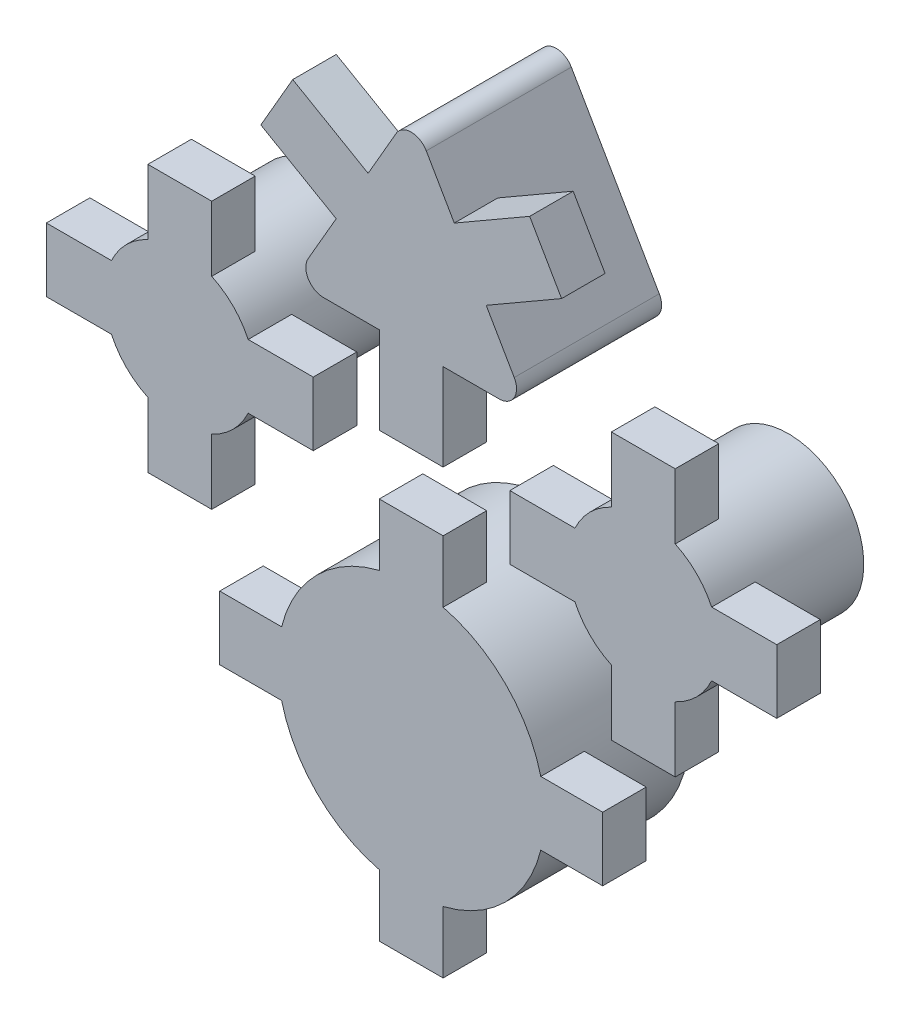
ISO-10303-21;
HEADER;
FILE_DESCRIPTION(('STEP AP214'),'2;1');
FILE_NAME('part.step','',(''),(''),'','','');
FILE_SCHEMA(('AUTOMOTIVE_DESIGN { 1 0 10303 214 1 1 1 1 }'));
ENDSEC;
DATA;
#1=APPLICATION_CONTEXT('core data for automotive mechanical design processes');
#2=APPLICATION_PROTOCOL_DEFINITION('international standard','automotive_design',2000,#1);
#3=PRODUCT_CONTEXT('',#1,'mechanical');
#4=PRODUCT('Part','Part','',(#3));
#5=PRODUCT_RELATED_PRODUCT_CATEGORY('part','',(#4));
#6=PRODUCT_DEFINITION_FORMATION('','',#4);
#7=PRODUCT_DEFINITION_CONTEXT('part definition',#1,'design');
#8=PRODUCT_DEFINITION('design','',#6,#7);
#9=PRODUCT_DEFINITION_SHAPE('','',#8);
#10=(LENGTH_UNIT() NAMED_UNIT(*) SI_UNIT(.MILLI.,.METRE.));
#11=(NAMED_UNIT(*) PLANE_ANGLE_UNIT() SI_UNIT($,.RADIAN.));
#12=(NAMED_UNIT(*) SI_UNIT($,.STERADIAN.) SOLID_ANGLE_UNIT());
#13=UNCERTAINTY_MEASURE_WITH_UNIT(LENGTH_MEASURE(1.E-05),#10,'distance_accuracy_value','');
#14=(GEOMETRIC_REPRESENTATION_CONTEXT(3) GLOBAL_UNCERTAINTY_ASSIGNED_CONTEXT((#13)) GLOBAL_UNIT_ASSIGNED_CONTEXT((#10,
#11,#12)) REPRESENTATION_CONTEXT('',''));
#15=CARTESIAN_POINT('',(0.,0.,0.));
#16=DIRECTION('',(0.,0.,1.));
#17=DIRECTION('',(1.,0.,0.));
#18=AXIS2_PLACEMENT_3D('',#15,#16,#17);
#19=CARTESIAN_POINT('',(0.,0.,-1.905));
#20=DIRECTION('',(0.,0.,1.));
#21=DIRECTION('',(0.,-1.,0.));
#22=AXIS2_PLACEMENT_3D('',#19,#20,#21);
#23=PLANE('',#22);
#24=DIRECTION('',(0.500000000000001,-0.866025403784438,0.));
#25=VECTOR('',#24,1.);
#26=CARTESIAN_POINT('',(-23.3718471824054,-28.2925874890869,-1.905));
#27=LINE('',#26,#25);
#28=CARTESIAN_POINT('',(-24.7688471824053,-25.8729125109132,-1.905));
#29=VERTEX_POINT('',#28);
#30=CARTESIAN_POINT('',(-23.3718471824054,-28.2925874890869,-1.905));
#31=VERTEX_POINT('',#30);
#32=EDGE_CURVE('E12',#29,#31,#27,.T.);
#33=ORIENTED_EDGE('',*,*,#32,.F.);
#34=DIRECTION('',(0.866025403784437,0.500000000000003,0.));
#35=VECTOR('',#34,1.);
#36=CARTESIAN_POINT('',(-21.4692903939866,-23.9679125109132,-1.905));
#37=LINE('',#36,#35);
#38=CARTESIAN_POINT('',(-21.4692903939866,-23.9679125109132,-1.905));
#39=VERTEX_POINT('',#38);
#40=EDGE_CURVE('E67',#29,#39,#37,.T.);
#41=ORIENTED_EDGE('',*,*,#40,.T.);
#42=DIRECTION('',(0.499999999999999,-0.866025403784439,0.));
#43=VECTOR('',#42,1.);
#44=CARTESIAN_POINT('',(-20.0722903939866,-26.3875874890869,-1.905));
#45=LINE('',#44,#43);
#46=CARTESIAN_POINT('',(-20.0722903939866,-26.3875874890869,-1.905));
#47=VERTEX_POINT('',#46);
#48=EDGE_CURVE('E62',#39,#47,#45,.T.);
#49=ORIENTED_EDGE('',*,*,#48,.T.);
#50=DIRECTION('',(-0.86602540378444,-0.499999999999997,0.));
#51=VECTOR('',#50,1.);
#52=CARTESIAN_POINT('',(-23.3718471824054,-28.2925874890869,-1.905));
#53=LINE('',#52,#51);
#54=EDGE_CURVE('E179',#47,#31,#53,.T.);
#55=ORIENTED_EDGE('',*,*,#54,.T.);
#56=EDGE_LOOP('',(#33,#41,#49,#55));
#57=FACE_BOUND('',#56,.T.);
#58=ADVANCED_FACE('F45',(#57),#23,.F.);
#59=DIRECTION('',(0.499999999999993,0.866025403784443,0.));
#60=VECTOR('',#59,1.);
#61=CARTESIAN_POINT('',(-28.5411528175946,-25.8729125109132,-1.905));
#62=LINE('',#61,#60);
#63=CARTESIAN_POINT('',(-29.9381528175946,-28.2925874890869,-1.905));
#64=VERTEX_POINT('',#63);
#65=CARTESIAN_POINT('',(-28.5411528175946,-25.8729125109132,-1.905));
#66=VERTEX_POINT('',#65);
#67=EDGE_CURVE('E54',#64,#66,#62,.T.);
#68=ORIENTED_EDGE('',*,*,#67,.F.);
#69=DIRECTION('',(-0.866025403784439,0.499999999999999,0.));
#70=VECTOR('',#69,1.);
#71=CARTESIAN_POINT('',(-33.2377096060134,-26.3875874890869,-1.905));
#72=LINE('',#71,#70);
#73=CARTESIAN_POINT('',(-33.2377096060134,-26.3875874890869,-1.905));
#74=VERTEX_POINT('',#73);
#75=EDGE_CURVE('E210',#64,#74,#72,.T.);
#76=ORIENTED_EDGE('',*,*,#75,.T.);
#77=DIRECTION('',(0.500000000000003,0.866025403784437,0.));
#78=VECTOR('',#77,1.);
#79=CARTESIAN_POINT('',(-31.8407096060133,-23.9679125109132,-1.905));
#80=LINE('',#79,#78);
#81=CARTESIAN_POINT('',(-31.8407096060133,-23.9679125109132,-1.905));
#82=VERTEX_POINT('',#81);
#83=EDGE_CURVE('E208',#74,#82,#80,.T.);
#84=ORIENTED_EDGE('',*,*,#83,.T.);
#85=DIRECTION('',(0.86602540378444,-0.499999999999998,0.));
#86=VECTOR('',#85,1.);
#87=CARTESIAN_POINT('',(-28.5411528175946,-25.8729125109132,-1.905));
#88=LINE('',#87,#86);
#89=EDGE_CURVE('E211',#82,#66,#88,.T.);
#90=ORIENTED_EDGE('',*,*,#89,.T.);
#91=EDGE_LOOP('',(#68,#76,#84,#90));
#92=FACE_BOUND('',#91,.T.);
#93=ADVANCED_FACE('F345',(#92),#23,.F.);
#94=DIRECTION('',(-1.,0.,0.));
#95=VECTOR('',#94,1.);
#96=CARTESIAN_POINT('',(-28.052,-31.5595,-1.905));
#97=LINE('',#96,#95);
#98=CARTESIAN_POINT('',(-25.258,-31.5595,-1.905));
#99=VERTEX_POINT('',#98);
#100=CARTESIAN_POINT('',(-28.052,-31.5595,-1.905));
#101=VERTEX_POINT('',#100);
#102=EDGE_CURVE('E315',#99,#101,#97,.T.);
#103=ORIENTED_EDGE('',*,*,#102,.F.);
#104=DIRECTION('',(0.,-1.,0.));
#105=VECTOR('',#104,1.);
#106=CARTESIAN_POINT('',(-25.258,-35.3695,-1.905));
#107=LINE('',#106,#105);
#108=CARTESIAN_POINT('',(-25.258,-35.3695,-1.905));
#109=VERTEX_POINT('',#108);
#110=EDGE_CURVE('E214',#99,#109,#107,.T.);
#111=ORIENTED_EDGE('',*,*,#110,.T.);
#112=DIRECTION('',(-1.,0.,0.));
#113=VECTOR('',#112,1.);
#114=CARTESIAN_POINT('',(-28.052,-35.3695,-1.905));
#115=LINE('',#114,#113);
#116=CARTESIAN_POINT('',(-28.052,-35.3695,-1.905));
#117=VERTEX_POINT('',#116);
#118=EDGE_CURVE('E212',#109,#117,#115,.T.);
#119=ORIENTED_EDGE('',*,*,#118,.T.);
#120=DIRECTION('',(0.,1.,0.));
#121=VECTOR('',#120,1.);
#122=CARTESIAN_POINT('',(-28.052,-31.5595,-1.905));
#123=LINE('',#122,#121);
#124=EDGE_CURVE('E215',#117,#101,#123,.T.);
#125=ORIENTED_EDGE('',*,*,#124,.T.);
#126=EDGE_LOOP('',(#103,#111,#119,#125));
#127=FACE_BOUND('',#126,.T.);
#128=ADVANCED_FACE('F379',(#127),#23,.F.);
#129=CARTESIAN_POINT('',(-22.8055170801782,-30.7975,-25.6128761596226));
#130=DIRECTION('',(0.,0.,1.));
#131=DIRECTION('',(1.,0.,0.));
#132=AXIS2_PLACEMENT_3D('',#129,#130,#131);
#133=CYLINDRICAL_SURFACE('',#132,0.761999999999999);
#134=DIRECTION('',(0.,0.,1.));
#135=VECTOR('',#134,1.);
#136=CARTESIAN_POINT('',(-22.8055170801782,-31.5595,-25.6128761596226));
#137=LINE('',#136,#135);
#138=CARTESIAN_POINT('',(-22.8055170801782,-31.5595,-6.35));
#139=VERTEX_POINT('',#138);
#140=CARTESIAN_POINT('',(-22.8055170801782,-31.5595,0.));
#141=VERTEX_POINT('',#140);
#142=EDGE_CURVE('E170',#139,#141,#137,.T.);
#143=ORIENTED_EDGE('',*,*,#142,.F.);
#144=CARTESIAN_POINT('',(-22.8055170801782,-30.7975,-6.35));
#145=DIRECTION('',(0.,0.,-1.));
#146=DIRECTION('',(-1.,0.,0.));
#147=AXIS2_PLACEMENT_3D('',#144,#145,#146);
#148=CIRCLE('',#147,0.761999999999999);
#149=CARTESIAN_POINT('',(-22.1456057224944,-30.4165,-6.35));
#150=VERTEX_POINT('',#149);
#151=EDGE_CURVE('E173',#150,#139,#148,.T.);
#152=ORIENTED_EDGE('',*,*,#151,.F.);
#153=DIRECTION('',(0.,0.,1.));
#154=VECTOR('',#153,1.);
#155=CARTESIAN_POINT('',(-22.1456057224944,-30.4165,-25.6128761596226));
#156=LINE('',#155,#154);
#157=CARTESIAN_POINT('',(-22.1456057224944,-30.4165,0.));
#158=VERTEX_POINT('',#157);
#159=EDGE_CURVE('E266',#150,#158,#156,.T.);
#160=ORIENTED_EDGE('',*,*,#159,.T.);
#161=CARTESIAN_POINT('',(-22.8055170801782,-30.7975,0.));
#162=DIRECTION('',(0.,0.,1.));
#163=DIRECTION('',(1.,0.,0.));
#164=AXIS2_PLACEMENT_3D('',#161,#162,#163);
#165=CIRCLE('',#164,0.761999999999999);
#166=EDGE_CURVE('E175',#141,#158,#165,.T.);
#167=ORIENTED_EDGE('',*,*,#166,.F.);
#168=EDGE_LOOP('',(#143,#152,#160,#167));
#169=FACE_BOUND('',#168,.T.);
#170=ADVANCED_FACE('F47',(#169),#133,.T.);
#171=CARTESIAN_POINT('',(-25.258,-31.5595,-25.6128761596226));
#172=DIRECTION('',(0.,-1.,0.));
#173=DIRECTION('',(0.,0.,-1.));
#174=AXIS2_PLACEMENT_3D('',#171,#172,#173);
#175=PLANE('',#174);
#176=DIRECTION('',(0.,0.,1.));
#177=VECTOR('',#176,1.);
#178=CARTESIAN_POINT('',(-25.258,-31.5595,-25.6128761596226));
#179=LINE('',#178,#177);
#180=CARTESIAN_POINT('',(-25.258,-31.5595,0.));
#181=VERTEX_POINT('',#180);
#182=EDGE_CURVE('E180',#99,#181,#179,.T.);
#183=ORIENTED_EDGE('',*,*,#182,.F.);
#184=ORIENTED_EDGE('',*,*,#102,.T.);
#185=DIRECTION('',(0.,0.,1.));
#186=VECTOR('',#185,1.);
#187=CARTESIAN_POINT('',(-28.052,-31.5595,-25.6128761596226));
#188=LINE('',#187,#186);
#189=CARTESIAN_POINT('',(-28.052,-31.5595,0.));
#190=VERTEX_POINT('',#189);
#191=EDGE_CURVE('E272',#101,#190,#188,.T.);
#192=ORIENTED_EDGE('',*,*,#191,.T.);
#193=DIRECTION('',(1.,0.,0.));
#194=VECTOR('',#193,1.);
#195=CARTESIAN_POINT('',(-30.5044829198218,-31.5595,0.));
#196=LINE('',#195,#194);
#197=CARTESIAN_POINT('',(-30.5044829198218,-31.5595,0.));
#198=VERTEX_POINT('',#197);
#199=EDGE_CURVE('E253',#198,#190,#196,.T.);
#200=ORIENTED_EDGE('',*,*,#199,.F.);
#201=DIRECTION('',(0.,0.,1.));
#202=VECTOR('',#201,1.);
#203=CARTESIAN_POINT('',(-30.5044829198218,-31.5595,-25.6128761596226));
#204=LINE('',#203,#202);
#205=CARTESIAN_POINT('',(-30.5044829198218,-31.5595,-6.35));
#206=VERTEX_POINT('',#205);
#207=EDGE_CURVE('E187',#206,#198,#204,.T.);
#208=ORIENTED_EDGE('',*,*,#207,.F.);
#209=DIRECTION('',(-1.,0.,0.));
#210=VECTOR('',#209,1.);
#211=CARTESIAN_POINT('',(-22.8055170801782,-31.5595,-6.35));
#212=LINE('',#211,#210);
#213=EDGE_CURVE('E183',#139,#206,#212,.T.);
#214=ORIENTED_EDGE('',*,*,#213,.F.);
#215=ORIENTED_EDGE('',*,*,#142,.T.);
#216=DIRECTION('',(1.,0.,0.));
#217=VECTOR('',#216,1.);
#218=CARTESIAN_POINT('',(-25.258,-31.5595,0.));
#219=LINE('',#218,#217);
#220=EDGE_CURVE('E265',#181,#141,#219,.T.);
#221=ORIENTED_EDGE('',*,*,#220,.F.);
#222=EDGE_LOOP('',(#183,#184,#192,#200,#208,#214,#215,#221));
#223=FACE_BOUND('',#222,.T.);
#224=ADVANCED_FACE('F185',(#223),#175,.T.);
#225=CARTESIAN_POINT('',(-25.258,-35.3695,-25.6128761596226));
#226=DIRECTION('',(1.,0.,0.));
#227=DIRECTION('',(0.,0.,-1.));
#228=AXIS2_PLACEMENT_3D('',#225,#226,#227);
#229=PLANE('',#228);
#230=ORIENTED_EDGE('',*,*,#110,.F.);
#231=ORIENTED_EDGE('',*,*,#182,.T.);
#232=DIRECTION('',(0.,1.,0.));
#233=VECTOR('',#232,1.);
#234=CARTESIAN_POINT('',(-25.258,-35.3695,0.));
#235=LINE('',#234,#233);
#236=CARTESIAN_POINT('',(-25.258,-35.3695,0.));
#237=VERTEX_POINT('',#236);
#238=EDGE_CURVE('E262',#237,#181,#235,.T.);
#239=ORIENTED_EDGE('',*,*,#238,.F.);
#240=DIRECTION('',(0.,0.,1.));
#241=VECTOR('',#240,1.);
#242=CARTESIAN_POINT('',(-25.258,-35.3695,-25.6128761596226));
#243=LINE('',#242,#241);
#244=EDGE_CURVE('E268',#109,#237,#243,.T.);
#245=ORIENTED_EDGE('',*,*,#244,.F.);
#246=EDGE_LOOP('',(#230,#231,#239,#245));
#247=FACE_BOUND('',#246,.T.);
#248=ADVANCED_FACE('F410',(#247),#229,.T.);
#249=CARTESIAN_POINT('',(-28.052,-35.3695,-25.6128761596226));
#250=DIRECTION('',(0.,-1.,0.));
#251=DIRECTION('',(0.,0.,-1.));
#252=AXIS2_PLACEMENT_3D('',#249,#250,#251);
#253=PLANE('',#252);
#254=ORIENTED_EDGE('',*,*,#118,.F.);
#255=ORIENTED_EDGE('',*,*,#244,.T.);
#256=DIRECTION('',(1.,0.,0.));
#257=VECTOR('',#256,1.);
#258=CARTESIAN_POINT('',(-28.052,-35.3695,0.));
#259=LINE('',#258,#257);
#260=CARTESIAN_POINT('',(-28.052,-35.3695,0.));
#261=VERTEX_POINT('',#260);
#262=EDGE_CURVE('E259',#261,#237,#259,.T.);
#263=ORIENTED_EDGE('',*,*,#262,.F.);
#264=DIRECTION('',(0.,0.,1.));
#265=VECTOR('',#264,1.);
#266=CARTESIAN_POINT('',(-28.052,-35.3695,-25.6128761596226));
#267=LINE('',#266,#265);
#268=EDGE_CURVE('E270',#117,#261,#267,.T.);
#269=ORIENTED_EDGE('',*,*,#268,.F.);
#270=EDGE_LOOP('',(#254,#255,#263,#269));
#271=FACE_BOUND('',#270,.T.);
#272=ADVANCED_FACE('F394',(#271),#253,.T.);
#273=CARTESIAN_POINT('',(-28.052,-31.5595,-25.6128761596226));
#274=DIRECTION('',(-1.,0.,0.));
#275=DIRECTION('',(0.,-1.,0.));
#276=AXIS2_PLACEMENT_3D('',#273,#274,#275);
#277=PLANE('',#276);
#278=ORIENTED_EDGE('',*,*,#124,.F.);
#279=ORIENTED_EDGE('',*,*,#268,.T.);
#280=DIRECTION('',(0.,-1.,0.));
#281=VECTOR('',#280,1.);
#282=CARTESIAN_POINT('',(-28.052,-31.5595,0.));
#283=LINE('',#282,#281);
#284=EDGE_CURVE('E256',#190,#261,#283,.T.);
#285=ORIENTED_EDGE('',*,*,#284,.F.);
#286=ORIENTED_EDGE('',*,*,#191,.F.);
#287=EDGE_LOOP('',(#278,#279,#285,#286));
#288=FACE_BOUND('',#287,.T.);
#289=ADVANCED_FACE('F384',(#288),#277,.T.);
#290=CARTESIAN_POINT('',(-30.5044829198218,-30.7975,-25.6128761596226));
#291=DIRECTION('',(0.,0.,1.));
#292=DIRECTION('',(1.,0.,0.));
#293=AXIS2_PLACEMENT_3D('',#290,#291,#292);
#294=CYLINDRICAL_SURFACE('',#293,0.761999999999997);
#295=DIRECTION('',(0.,0.,1.));
#296=VECTOR('',#295,1.);
#297=CARTESIAN_POINT('',(-31.1643942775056,-30.4165,-25.6128761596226));
#298=LINE('',#297,#296);
#299=CARTESIAN_POINT('',(-31.1643942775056,-30.4165,-6.35));
#300=VERTEX_POINT('',#299);
#301=CARTESIAN_POINT('',(-31.1643942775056,-30.4165,0.));
#302=VERTEX_POINT('',#301);
#303=EDGE_CURVE('E274',#300,#302,#298,.T.);
#304=ORIENTED_EDGE('',*,*,#303,.F.);
#305=CARTESIAN_POINT('',(-30.5044829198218,-30.7975,-6.35));
#306=DIRECTION('',(0.,0.,-1.));
#307=DIRECTION('',(-1.,0.,0.));
#308=AXIS2_PLACEMENT_3D('',#305,#306,#307);
#309=CIRCLE('',#308,0.761999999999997);
#310=EDGE_CURVE('E191',#206,#300,#309,.T.);
#311=ORIENTED_EDGE('',*,*,#310,.F.);
#312=ORIENTED_EDGE('',*,*,#207,.T.);
#313=CARTESIAN_POINT('',(-30.5044829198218,-30.7975,0.));
#314=DIRECTION('',(0.,0.,1.));
#315=DIRECTION('',(1.,0.,0.));
#316=AXIS2_PLACEMENT_3D('',#313,#314,#315);
#317=CIRCLE('',#316,0.761999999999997);
#318=EDGE_CURVE('E250',#302,#198,#317,.T.);
#319=ORIENTED_EDGE('',*,*,#318,.F.);
#320=EDGE_LOOP('',(#304,#311,#312,#319));
#321=FACE_BOUND('',#320,.T.);
#322=ADVANCED_FACE('F386',(#321),#294,.T.);
#323=CARTESIAN_POINT('',(-29.9381528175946,-28.2925874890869,-25.6128761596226));
#324=DIRECTION('',(-0.866025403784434,0.500000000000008,0.));
#325=DIRECTION('',(-0.500000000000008,-0.866025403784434,0.));
#326=AXIS2_PLACEMENT_3D('',#323,#324,#325);
#327=PLANE('',#326);
#328=DIRECTION('',(0.,0.,1.));
#329=VECTOR('',#328,1.);
#330=CARTESIAN_POINT('',(-29.9381528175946,-28.2925874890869,-25.6128761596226));
#331=LINE('',#330,#329);
#332=CARTESIAN_POINT('',(-29.9381528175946,-28.2925874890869,0.));
#333=VERTEX_POINT('',#332);
#334=EDGE_CURVE('E276',#64,#333,#331,.T.);
#335=ORIENTED_EDGE('',*,*,#334,.F.);
#336=ORIENTED_EDGE('',*,*,#67,.T.);
#337=DIRECTION('',(0.,0.,1.));
#338=VECTOR('',#337,1.);
#339=CARTESIAN_POINT('',(-28.5411528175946,-25.8729125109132,-25.6128761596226));
#340=LINE('',#339,#338);
#341=CARTESIAN_POINT('',(-28.5411528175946,-25.8729125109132,0.));
#342=VERTEX_POINT('',#341);
#343=EDGE_CURVE('E281',#66,#342,#340,.T.);
#344=ORIENTED_EDGE('',*,*,#343,.T.);
#345=DIRECTION('',(-0.499999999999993,-0.866025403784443,0.));
#346=VECTOR('',#345,1.);
#347=CARTESIAN_POINT('',(-27.3149113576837,-23.749,0.));
#348=LINE('',#347,#346);
#349=CARTESIAN_POINT('',(-27.3149113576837,-23.749,0.));
#350=VERTEX_POINT('',#349);
#351=EDGE_CURVE('E235',#350,#342,#348,.T.);
#352=ORIENTED_EDGE('',*,*,#351,.F.);
#353=DIRECTION('',(0.,0.,1.));
#354=VECTOR('',#353,1.);
#355=CARTESIAN_POINT('',(-27.3149113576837,-23.749,-25.6128761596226));
#356=LINE('',#355,#354);
#357=CARTESIAN_POINT('',(-27.3149113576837,-23.749,-6.35));
#358=VERTEX_POINT('',#357);
#359=EDGE_CURVE('E282',#358,#350,#356,.T.);
#360=ORIENTED_EDGE('',*,*,#359,.F.);
#361=DIRECTION('',(0.500000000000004,0.866025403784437,0.));
#362=VECTOR('',#361,1.);
#363=CARTESIAN_POINT('',(-31.1643942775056,-30.4165,-6.35));
#364=LINE('',#363,#362);
#365=EDGE_CURVE('E201',#300,#358,#364,.T.);
#366=ORIENTED_EDGE('',*,*,#365,.F.);
#367=ORIENTED_EDGE('',*,*,#303,.T.);
#368=DIRECTION('',(-0.500000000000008,-0.866025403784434,0.));
#369=VECTOR('',#368,1.);
#370=CARTESIAN_POINT('',(-29.9381528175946,-28.2925874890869,0.));
#371=LINE('',#370,#369);
#372=EDGE_CURVE('E247',#333,#302,#371,.T.);
#373=ORIENTED_EDGE('',*,*,#372,.F.);
#374=EDGE_LOOP('',(#335,#336,#344,#352,#360,#366,#367,#373));
#375=FACE_BOUND('',#374,.T.);
#376=ADVANCED_FACE('F332',(#375),#327,.T.);
#377=CARTESIAN_POINT('',(-33.2377096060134,-26.3875874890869,-25.6128761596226));
#378=DIRECTION('',(-0.499999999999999,-0.866025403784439,0.));
#379=DIRECTION('',(0.866025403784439,-0.499999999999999,0.));
#380=AXIS2_PLACEMENT_3D('',#377,#378,#379);
#381=PLANE('',#380);
#382=ORIENTED_EDGE('',*,*,#75,.F.);
#383=ORIENTED_EDGE('',*,*,#334,.T.);
#384=DIRECTION('',(0.866025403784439,-0.499999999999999,0.));
#385=VECTOR('',#384,1.);
#386=CARTESIAN_POINT('',(-33.2377096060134,-26.3875874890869,0.));
#387=LINE('',#386,#385);
#388=CARTESIAN_POINT('',(-33.2377096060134,-26.3875874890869,0.));
#389=VERTEX_POINT('',#388);
#390=EDGE_CURVE('E244',#389,#333,#387,.T.);
#391=ORIENTED_EDGE('',*,*,#390,.F.);
#392=DIRECTION('',(0.,0.,1.));
#393=VECTOR('',#392,1.);
#394=CARTESIAN_POINT('',(-33.2377096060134,-26.3875874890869,-25.6128761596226));
#395=LINE('',#394,#393);
#396=EDGE_CURVE('E277',#74,#389,#395,.T.);
#397=ORIENTED_EDGE('',*,*,#396,.F.);
#398=EDGE_LOOP('',(#382,#383,#391,#397));
#399=FACE_BOUND('',#398,.T.);
#400=ADVANCED_FACE('F329',(#399),#381,.T.);
#401=CARTESIAN_POINT('',(-31.8407096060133,-23.9679125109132,-25.6128761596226));
#402=DIRECTION('',(-0.866025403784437,0.500000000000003,0.));
#403=DIRECTION('',(-0.500000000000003,-0.866025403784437,0.));
#404=AXIS2_PLACEMENT_3D('',#401,#402,#403);
#405=PLANE('',#404);
#406=ORIENTED_EDGE('',*,*,#83,.F.);
#407=ORIENTED_EDGE('',*,*,#396,.T.);
#408=DIRECTION('',(-0.500000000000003,-0.866025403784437,0.));
#409=VECTOR('',#408,1.);
#410=CARTESIAN_POINT('',(-31.8407096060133,-23.9679125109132,0.));
#411=LINE('',#410,#409);
#412=CARTESIAN_POINT('',(-31.8407096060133,-23.9679125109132,0.));
#413=VERTEX_POINT('',#412);
#414=EDGE_CURVE('E241',#413,#389,#411,.T.);
#415=ORIENTED_EDGE('',*,*,#414,.F.);
#416=DIRECTION('',(0.,0.,1.));
#417=VECTOR('',#416,1.);
#418=CARTESIAN_POINT('',(-31.8407096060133,-23.9679125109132,-25.6128761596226));
#419=LINE('',#418,#417);
#420=EDGE_CURVE('E279',#82,#413,#419,.T.);
#421=ORIENTED_EDGE('',*,*,#420,.F.);
#422=EDGE_LOOP('',(#406,#407,#415,#421));
#423=FACE_BOUND('',#422,.T.);
#424=ADVANCED_FACE('F342',(#423),#405,.T.);
#425=CARTESIAN_POINT('',(-28.5411528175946,-25.8729125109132,-25.6128761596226));
#426=DIRECTION('',(0.499999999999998,0.86602540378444,0.));
#427=DIRECTION('',(-0.86602540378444,0.499999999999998,0.));
#428=AXIS2_PLACEMENT_3D('',#425,#426,#427);
#429=PLANE('',#428);
#430=ORIENTED_EDGE('',*,*,#89,.F.);
#431=ORIENTED_EDGE('',*,*,#420,.T.);
#432=DIRECTION('',(-0.86602540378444,0.499999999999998,0.));
#433=VECTOR('',#432,1.);
#434=CARTESIAN_POINT('',(-28.5411528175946,-25.8729125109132,0.));
#435=LINE('',#434,#433);
#436=EDGE_CURVE('E238',#342,#413,#435,.T.);
#437=ORIENTED_EDGE('',*,*,#436,.F.);
#438=ORIENTED_EDGE('',*,*,#343,.F.);
#439=EDGE_LOOP('',(#430,#431,#437,#438));
#440=FACE_BOUND('',#439,.T.);
#441=ADVANCED_FACE('F348',(#440),#429,.T.);
#442=CARTESIAN_POINT('',(-26.655,-24.13,-25.6128761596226));
#443=DIRECTION('',(0.,0.,1.));
#444=DIRECTION('',(1.,0.,0.));
#445=AXIS2_PLACEMENT_3D('',#442,#443,#444);
#446=CYLINDRICAL_SURFACE('',#445,0.762);
#447=DIRECTION('',(0.,0.,1.));
#448=VECTOR('',#447,1.);
#449=CARTESIAN_POINT('',(-25.9950886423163,-23.749,-25.6128761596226));
#450=LINE('',#449,#448);
#451=CARTESIAN_POINT('',(-25.9950886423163,-23.749,-6.35));
#452=VERTEX_POINT('',#451);
#453=CARTESIAN_POINT('',(-25.9950886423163,-23.749,0.));
#454=VERTEX_POINT('',#453);
#455=EDGE_CURVE('E284',#452,#454,#450,.T.);
#456=ORIENTED_EDGE('',*,*,#455,.F.);
#457=CARTESIAN_POINT('',(-26.655,-24.13,-6.35));
#458=DIRECTION('',(0.,0.,-1.));
#459=DIRECTION('',(-1.,0.,0.));
#460=AXIS2_PLACEMENT_3D('',#457,#458,#459);
#461=CIRCLE('',#460,0.762);
#462=EDGE_CURVE('E204',#358,#452,#461,.T.);
#463=ORIENTED_EDGE('',*,*,#462,.F.);
#464=ORIENTED_EDGE('',*,*,#359,.T.);
#465=CARTESIAN_POINT('',(-26.655,-24.13,0.));
#466=DIRECTION('',(0.,0.,1.));
#467=DIRECTION('',(1.,0.,0.));
#468=AXIS2_PLACEMENT_3D('',#465,#466,#467);
#469=CIRCLE('',#468,0.762);
#470=EDGE_CURVE('E232',#454,#350,#469,.T.);
#471=ORIENTED_EDGE('',*,*,#470,.F.);
#472=EDGE_LOOP('',(#456,#463,#464,#471));
#473=FACE_BOUND('',#472,.T.);
#474=ADVANCED_FACE('F353',(#473),#446,.T.);
#475=CARTESIAN_POINT('',(-24.7688471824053,-25.8729125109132,-25.6128761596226));
#476=DIRECTION('',(0.866025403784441,0.499999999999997,0.));
#477=DIRECTION('',(-0.499999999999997,0.866025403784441,0.));
#478=AXIS2_PLACEMENT_3D('',#475,#476,#477);
#479=PLANE('',#478);
#480=DIRECTION('',(0.,0.,1.));
#481=VECTOR('',#480,1.);
#482=CARTESIAN_POINT('',(-24.7688471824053,-25.8729125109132,-25.6128761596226));
#483=LINE('',#482,#481);
#484=CARTESIAN_POINT('',(-24.7688471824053,-25.8729125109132,0.));
#485=VERTEX_POINT('',#484);
#486=EDGE_CURVE('E286',#29,#485,#483,.T.);
#487=ORIENTED_EDGE('',*,*,#486,.F.);
#488=ORIENTED_EDGE('',*,*,#32,.T.);
#489=DIRECTION('',(0.,0.,1.));
#490=VECTOR('',#489,1.);
#491=CARTESIAN_POINT('',(-23.3718471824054,-28.2925874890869,-25.6128761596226));
#492=LINE('',#491,#490);
#493=CARTESIAN_POINT('',(-23.3718471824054,-28.2925874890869,0.));
#494=VERTEX_POINT('',#493);
#495=EDGE_CURVE('E291',#31,#494,#492,.T.);
#496=ORIENTED_EDGE('',*,*,#495,.T.);
#497=DIRECTION('',(-0.500000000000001,0.866025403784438,0.));
#498=VECTOR('',#497,1.);
#499=CARTESIAN_POINT('',(-22.1456057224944,-30.4165,0.));
#500=LINE('',#499,#498);
#501=EDGE_CURVE('E217',#158,#494,#500,.T.);
#502=ORIENTED_EDGE('',*,*,#501,.F.);
#503=ORIENTED_EDGE('',*,*,#159,.F.);
#504=DIRECTION('',(0.499999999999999,-0.866025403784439,0.));
#505=VECTOR('',#504,1.);
#506=CARTESIAN_POINT('',(-25.9950886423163,-23.749,-6.35));
#507=LINE('',#506,#505);
#508=EDGE_CURVE('E197',#452,#150,#507,.T.);
#509=ORIENTED_EDGE('',*,*,#508,.F.);
#510=ORIENTED_EDGE('',*,*,#455,.T.);
#511=DIRECTION('',(-0.499999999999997,0.866025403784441,0.));
#512=VECTOR('',#511,1.);
#513=CARTESIAN_POINT('',(-24.7688471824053,-25.8729125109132,0.));
#514=LINE('',#513,#512);
#515=EDGE_CURVE('E229',#485,#454,#514,.T.);
#516=ORIENTED_EDGE('',*,*,#515,.F.);
#517=EDGE_LOOP('',(#487,#488,#496,#502,#503,#509,#510,#516));
#518=FACE_BOUND('',#517,.T.);
#519=ADVANCED_FACE('F357',(#518),#479,.T.);
#520=CARTESIAN_POINT('',(-21.4692903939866,-23.9679125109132,-25.6128761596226));
#521=DIRECTION('',(-0.500000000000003,0.866025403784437,0.));
#522=DIRECTION('',(-0.866025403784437,-0.500000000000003,0.));
#523=AXIS2_PLACEMENT_3D('',#520,#521,#522);
#524=PLANE('',#523);
#525=ORIENTED_EDGE('',*,*,#40,.F.);
#526=ORIENTED_EDGE('',*,*,#486,.T.);
#527=DIRECTION('',(-0.866025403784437,-0.500000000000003,0.));
#528=VECTOR('',#527,1.);
#529=CARTESIAN_POINT('',(-21.4692903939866,-23.9679125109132,0.));
#530=LINE('',#529,#528);
#531=CARTESIAN_POINT('',(-21.4692903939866,-23.9679125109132,0.));
#532=VERTEX_POINT('',#531);
#533=EDGE_CURVE('E226',#532,#485,#530,.T.);
#534=ORIENTED_EDGE('',*,*,#533,.F.);
#535=DIRECTION('',(0.,0.,1.));
#536=VECTOR('',#535,1.);
#537=CARTESIAN_POINT('',(-21.4692903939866,-23.9679125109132,-25.6128761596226));
#538=LINE('',#537,#536);
#539=EDGE_CURVE('E287',#39,#532,#538,.T.);
#540=ORIENTED_EDGE('',*,*,#539,.F.);
#541=EDGE_LOOP('',(#525,#526,#534,#540));
#542=FACE_BOUND('',#541,.T.);
#543=ADVANCED_FACE('F483',(#542),#524,.T.);
#544=CARTESIAN_POINT('',(-20.0722903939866,-26.3875874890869,-25.6128761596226));
#545=DIRECTION('',(0.866025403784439,0.499999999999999,0.));
#546=DIRECTION('',(-0.499999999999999,0.866025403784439,0.));
#547=AXIS2_PLACEMENT_3D('',#544,#545,#546);
#548=PLANE('',#547);
#549=ORIENTED_EDGE('',*,*,#48,.F.);
#550=ORIENTED_EDGE('',*,*,#539,.T.);
#551=DIRECTION('',(-0.499999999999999,0.866025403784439,0.));
#552=VECTOR('',#551,1.);
#553=CARTESIAN_POINT('',(-20.0722903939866,-26.3875874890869,0.));
#554=LINE('',#553,#552);
#555=CARTESIAN_POINT('',(-20.0722903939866,-26.3875874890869,0.));
#556=VERTEX_POINT('',#555);
#557=EDGE_CURVE('E223',#556,#532,#554,.T.);
#558=ORIENTED_EDGE('',*,*,#557,.F.);
#559=DIRECTION('',(0.,0.,1.));
#560=VECTOR('',#559,1.);
#561=CARTESIAN_POINT('',(-20.0722903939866,-26.3875874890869,-25.6128761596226));
#562=LINE('',#561,#560);
#563=EDGE_CURVE('E289',#47,#556,#562,.T.);
#564=ORIENTED_EDGE('',*,*,#563,.F.);
#565=EDGE_LOOP('',(#549,#550,#558,#564));
#566=FACE_BOUND('',#565,.T.);
#567=ADVANCED_FACE('F493',(#566),#548,.T.);
#568=CARTESIAN_POINT('',(-23.3718471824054,-28.2925874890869,-25.6128761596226));
#569=DIRECTION('',(0.499999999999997,-0.86602540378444,0.));
#570=DIRECTION('',(0.86602540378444,0.499999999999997,0.));
#571=AXIS2_PLACEMENT_3D('',#568,#569,#570);
#572=PLANE('',#571);
#573=ORIENTED_EDGE('',*,*,#54,.F.);
#574=ORIENTED_EDGE('',*,*,#563,.T.);
#575=DIRECTION('',(0.866025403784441,0.499999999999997,0.));
#576=VECTOR('',#575,1.);
#577=CARTESIAN_POINT('',(-23.3718471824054,-28.2925874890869,0.));
#578=LINE('',#577,#576);
#579=EDGE_CURVE('E220',#494,#556,#578,.T.);
#580=ORIENTED_EDGE('',*,*,#579,.F.);
#581=ORIENTED_EDGE('',*,*,#495,.F.);
#582=EDGE_LOOP('',(#573,#574,#580,#581));
#583=FACE_BOUND('',#582,.T.);
#584=ADVANCED_FACE('F502',(#583),#572,.T.);
#585=CARTESIAN_POINT('',(-22.8055170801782,-30.7975,0.));
#586=DIRECTION('',(0.,0.,1.));
#587=DIRECTION('',(1.,0.,0.));
#588=AXIS2_PLACEMENT_3D('',#585,#586,#587);
#589=PLANE('',#588);
#590=ORIENTED_EDGE('',*,*,#166,.T.);
#591=ORIENTED_EDGE('',*,*,#501,.T.);
#592=ORIENTED_EDGE('',*,*,#579,.T.);
#593=ORIENTED_EDGE('',*,*,#557,.T.);
#594=ORIENTED_EDGE('',*,*,#533,.T.);
#595=ORIENTED_EDGE('',*,*,#515,.T.);
#596=ORIENTED_EDGE('',*,*,#470,.T.);
#597=ORIENTED_EDGE('',*,*,#351,.T.);
#598=ORIENTED_EDGE('',*,*,#436,.T.);
#599=ORIENTED_EDGE('',*,*,#414,.T.);
#600=ORIENTED_EDGE('',*,*,#390,.T.);
#601=ORIENTED_EDGE('',*,*,#372,.T.);
#602=ORIENTED_EDGE('',*,*,#318,.T.);
#603=ORIENTED_EDGE('',*,*,#199,.T.);
#604=ORIENTED_EDGE('',*,*,#284,.T.);
#605=ORIENTED_EDGE('',*,*,#262,.T.);
#606=ORIENTED_EDGE('',*,*,#238,.T.);
#607=ORIENTED_EDGE('',*,*,#220,.T.);
#608=EDGE_LOOP('',(#590,#591,#592,#593,#594,#595,#596,#597,#598,#599,#600,#601,#602,#603,#604,
#605,#606,#607));
#609=FACE_BOUND('',#608,.T.);
#610=ADVANCED_FACE('F336',(#609),#589,.T.);
#611=CARTESIAN_POINT('',(-22.8055170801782,-30.7975,-6.35));
#612=DIRECTION('',(0.,0.,-1.));
#613=DIRECTION('',(-1.,0.,0.));
#614=AXIS2_PLACEMENT_3D('',#611,#612,#613);
#615=PLANE('',#614);
#616=ORIENTED_EDGE('',*,*,#151,.T.);
#617=ORIENTED_EDGE('',*,*,#213,.T.);
#618=ORIENTED_EDGE('',*,*,#310,.T.);
#619=ORIENTED_EDGE('',*,*,#365,.T.);
#620=ORIENTED_EDGE('',*,*,#462,.T.);
#621=ORIENTED_EDGE('',*,*,#508,.T.);
#622=EDGE_LOOP('',(#616,#617,#618,#619,#620,#621));
#623=FACE_BOUND('',#622,.T.);
#624=ADVANCED_FACE('F194',(#623),#615,.T.);
#625=CLOSED_SHELL('',(#58,#93,#128,#170,#224,#248,#272,#289,#322,#376,#400,#424,#441,#474,#519,
#543,#567,#584,#610,#624));
#626=MANIFOLD_SOLID_BREP('B2',#625);
#627=CARTESIAN_POINT('',(0.,0.,-1.905));
#628=DIRECTION('',(0.,0.,1.));
#629=DIRECTION('',(0.,-1.,0.));
#630=AXIS2_PLACEMENT_3D('',#627,#628,#629);
#631=PLANE('',#630);
#632=CARTESIAN_POINT('',(-16.495,-36.195,-1.905));
#633=DIRECTION('',(0.,0.,-1.));
#634=DIRECTION('',(-1.,0.,0.));
#635=AXIS2_PLACEMENT_3D('',#632,#633,#634);
#636=CIRCLE('',#635,3.302);
#637=CARTESIAN_POINT('',(-17.892,-33.203078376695,-1.905));
#638=VERTEX_POINT('',#637);
#639=CARTESIAN_POINT('',(-15.098,-33.203078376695,-1.905));
#640=VERTEX_POINT('',#639);
#641=EDGE_CURVE('E43',#638,#640,#636,.T.);
#642=ORIENTED_EDGE('',*,*,#641,.F.);
#643=DIRECTION('',(0.,1.,0.));
#644=VECTOR('',#643,1.);
#645=CARTESIAN_POINT('',(-17.892,-30.353,-1.905));
#646=LINE('',#645,#644);
#647=CARTESIAN_POINT('',(-17.892,-30.353,-1.905));
#648=VERTEX_POINT('',#647);
#649=EDGE_CURVE('E899',#638,#648,#646,.T.);
#650=ORIENTED_EDGE('',*,*,#649,.T.);
#651=DIRECTION('',(1.,0.,0.));
#652=VECTOR('',#651,1.);
#653=CARTESIAN_POINT('',(-15.098,-30.353,-1.905));
#654=LINE('',#653,#652);
#655=CARTESIAN_POINT('',(-15.098,-30.353,-1.905));
#656=VERTEX_POINT('',#655);
#657=EDGE_CURVE('E886',#648,#656,#654,.T.);
#658=ORIENTED_EDGE('',*,*,#657,.T.);
#659=DIRECTION('',(0.,-1.,0.));
#660=VECTOR('',#659,1.);
#661=CARTESIAN_POINT('',(-15.098,-33.203078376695,-1.905));
#662=LINE('',#661,#660);
#663=EDGE_CURVE('E896',#656,#640,#662,.T.);
#664=ORIENTED_EDGE('',*,*,#663,.T.);
#665=EDGE_LOOP('',(#642,#650,#658,#664));
#666=FACE_BOUND('',#665,.T.);
#667=ADVANCED_FACE('F606',(#666),#631,.F.);
#668=CARTESIAN_POINT('',(-13.503078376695,-34.798,-1.905));
#669=VERTEX_POINT('',#668);
#670=CARTESIAN_POINT('',(-13.503078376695,-37.592,-1.905));
#671=VERTEX_POINT('',#670);
#672=EDGE_CURVE('E616',#669,#671,#636,.T.);
#673=ORIENTED_EDGE('',*,*,#672,.F.);
#674=DIRECTION('',(1.,0.,0.));
#675=VECTOR('',#674,1.);
#676=CARTESIAN_POINT('',(-10.653,-34.798,-1.905));
#677=LINE('',#676,#675);
#678=CARTESIAN_POINT('',(-10.653,-34.798,-1.905));
#679=VERTEX_POINT('',#678);
#680=EDGE_CURVE('E898',#669,#679,#677,.T.);
#681=ORIENTED_EDGE('',*,*,#680,.T.);
#682=DIRECTION('',(0.,-1.,0.));
#683=VECTOR('',#682,1.);
#684=CARTESIAN_POINT('',(-10.653,-37.592,-1.905));
#685=LINE('',#684,#683);
#686=CARTESIAN_POINT('',(-10.653,-37.592,-1.905));
#687=VERTEX_POINT('',#686);
#688=EDGE_CURVE('E900',#679,#687,#685,.T.);
#689=ORIENTED_EDGE('',*,*,#688,.T.);
#690=DIRECTION('',(-1.,0.,0.));
#691=VECTOR('',#690,1.);
#692=CARTESIAN_POINT('',(-13.503078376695,-37.592,-1.905));
#693=LINE('',#692,#691);
#694=EDGE_CURVE('E685',#687,#671,#693,.T.);
#695=ORIENTED_EDGE('',*,*,#694,.T.);
#696=EDGE_LOOP('',(#673,#681,#689,#695));
#697=FACE_BOUND('',#696,.T.);
#698=ADVANCED_FACE('F933',(#697),#631,.F.);
#699=CARTESIAN_POINT('',(-15.098,-39.186921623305,-1.905));
#700=VERTEX_POINT('',#699);
#701=CARTESIAN_POINT('',(-17.892,-39.186921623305,-1.905));
#702=VERTEX_POINT('',#701);
#703=EDGE_CURVE('E665',#700,#702,#636,.T.);
#704=ORIENTED_EDGE('',*,*,#703,.F.);
#705=DIRECTION('',(0.,-1.,0.));
#706=VECTOR('',#705,1.);
#707=CARTESIAN_POINT('',(-15.098,-42.037,-1.905));
#708=LINE('',#707,#706);
#709=CARTESIAN_POINT('',(-15.098,-42.037,-1.905));
#710=VERTEX_POINT('',#709);
#711=EDGE_CURVE('E668',#700,#710,#708,.T.);
#712=ORIENTED_EDGE('',*,*,#711,.T.);
#713=DIRECTION('',(-1.,0.,0.));
#714=VECTOR('',#713,1.);
#715=CARTESIAN_POINT('',(-17.892,-42.037,-1.905));
#716=LINE('',#715,#714);
#717=CARTESIAN_POINT('',(-17.892,-42.037,-1.905));
#718=VERTEX_POINT('',#717);
#719=EDGE_CURVE('E686',#710,#718,#716,.T.);
#720=ORIENTED_EDGE('',*,*,#719,.T.);
#721=DIRECTION('',(0.,1.,0.));
#722=VECTOR('',#721,1.);
#723=CARTESIAN_POINT('',(-17.892,-39.186921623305,-1.905));
#724=LINE('',#723,#722);
#725=EDGE_CURVE('E624',#718,#702,#724,.T.);
#726=ORIENTED_EDGE('',*,*,#725,.T.);
#727=EDGE_LOOP('',(#704,#712,#720,#726));
#728=FACE_BOUND('',#727,.T.);
#729=ADVANCED_FACE('F667',(#728),#631,.F.);
#730=CARTESIAN_POINT('',(-19.486921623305,-37.592,-1.905));
#731=VERTEX_POINT('',#730);
#732=CARTESIAN_POINT('',(-19.486921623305,-34.798,-1.905));
#733=VERTEX_POINT('',#732);
#734=EDGE_CURVE('E673',#731,#733,#636,.T.);
#735=ORIENTED_EDGE('',*,*,#734,.F.);
#736=DIRECTION('',(-1.,0.,0.));
#737=VECTOR('',#736,1.);
#738=CARTESIAN_POINT('',(-22.337,-37.592,-1.905));
#739=LINE('',#738,#737);
#740=CARTESIAN_POINT('',(-22.337,-37.592,-1.905));
#741=VERTEX_POINT('',#740);
#742=EDGE_CURVE('E728',#731,#741,#739,.T.);
#743=ORIENTED_EDGE('',*,*,#742,.T.);
#744=DIRECTION('',(0.,1.,0.));
#745=VECTOR('',#744,1.);
#746=CARTESIAN_POINT('',(-22.337,-34.798,-1.905));
#747=LINE('',#746,#745);
#748=CARTESIAN_POINT('',(-22.337,-34.798,-1.905));
#749=VERTEX_POINT('',#748);
#750=EDGE_CURVE('E862',#741,#749,#747,.T.);
#751=ORIENTED_EDGE('',*,*,#750,.T.);
#752=DIRECTION('',(1.,0.,0.));
#753=VECTOR('',#752,1.);
#754=CARTESIAN_POINT('',(-19.486921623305,-34.798,-1.905));
#755=LINE('',#754,#753);
#756=EDGE_CURVE('E909',#749,#733,#755,.T.);
#757=ORIENTED_EDGE('',*,*,#756,.T.);
#758=EDGE_LOOP('',(#735,#743,#751,#757));
#759=FACE_BOUND('',#758,.T.);
#760=ADVANCED_FACE('F918',(#759),#631,.F.);
#761=CARTESIAN_POINT('',(-22.337,-37.592,-25.6128761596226));
#762=DIRECTION('',(0.,-1.,0.));
#763=DIRECTION('',(1.,0.,0.));
#764=AXIS2_PLACEMENT_3D('',#761,#762,#763);
#765=PLANE('',#764);
#766=ORIENTED_EDGE('',*,*,#742,.F.);
#767=DIRECTION('',(0.,0.,1.));
#768=VECTOR('',#767,1.);
#769=CARTESIAN_POINT('',(-19.486921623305,-37.592,-25.6128761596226));
#770=LINE('',#769,#768);
#771=CARTESIAN_POINT('',(-19.486921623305,-37.592,0.));
#772=VERTEX_POINT('',#771);
#773=EDGE_CURVE('E754',#731,#772,#770,.T.);
#774=ORIENTED_EDGE('',*,*,#773,.T.);
#775=DIRECTION('',(1.,0.,0.));
#776=VECTOR('',#775,1.);
#777=CARTESIAN_POINT('',(-22.337,-37.592,0.));
#778=LINE('',#777,#776);
#779=CARTESIAN_POINT('',(-22.337,-37.592,0.));
#780=VERTEX_POINT('',#779);
#781=EDGE_CURVE('E733',#780,#772,#778,.T.);
#782=ORIENTED_EDGE('',*,*,#781,.F.);
#783=DIRECTION('',(0.,0.,1.));
#784=VECTOR('',#783,1.);
#785=CARTESIAN_POINT('',(-22.337,-37.592,-25.6128761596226));
#786=LINE('',#785,#784);
#787=EDGE_CURVE('E751',#741,#780,#786,.T.);
#788=ORIENTED_EDGE('',*,*,#787,.F.);
#789=EDGE_LOOP('',(#766,#774,#782,#788));
#790=FACE_BOUND('',#789,.T.);
#791=ADVANCED_FACE('F922',(#790),#765,.T.);
#792=CARTESIAN_POINT('',(-22.337,-34.798,-25.6128761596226));
#793=DIRECTION('',(-1.,0.,0.));
#794=DIRECTION('',(0.,0.,1.));
#795=AXIS2_PLACEMENT_3D('',#792,#793,#794);
#796=PLANE('',#795);
#797=ORIENTED_EDGE('',*,*,#750,.F.);
#798=ORIENTED_EDGE('',*,*,#787,.T.);
#799=DIRECTION('',(0.,-1.,0.));
#800=VECTOR('',#799,1.);
#801=CARTESIAN_POINT('',(-22.337,-34.798,0.));
#802=LINE('',#801,#800);
#803=CARTESIAN_POINT('',(-22.337,-34.798,0.));
#804=VERTEX_POINT('',#803);
#805=EDGE_CURVE('E740',#804,#780,#802,.T.);
#806=ORIENTED_EDGE('',*,*,#805,.F.);
#807=DIRECTION('',(0.,0.,1.));
#808=VECTOR('',#807,1.);
#809=CARTESIAN_POINT('',(-22.337,-34.798,-25.6128761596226));
#810=LINE('',#809,#808);
#811=EDGE_CURVE('E755',#749,#804,#810,.T.);
#812=ORIENTED_EDGE('',*,*,#811,.F.);
#813=EDGE_LOOP('',(#797,#798,#806,#812));
#814=FACE_BOUND('',#813,.T.);
#815=ADVANCED_FACE('F921',(#814),#796,.T.);
#816=CARTESIAN_POINT('',(-19.486921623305,-34.798,-25.6128761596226));
#817=DIRECTION('',(0.,1.,0.));
#818=DIRECTION('',(0.,0.,1.));
#819=AXIS2_PLACEMENT_3D('',#816,#817,#818);
#820=PLANE('',#819);
#821=ORIENTED_EDGE('',*,*,#756,.F.);
#822=ORIENTED_EDGE('',*,*,#811,.T.);
#823=DIRECTION('',(-1.,0.,0.));
#824=VECTOR('',#823,1.);
#825=CARTESIAN_POINT('',(-19.486921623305,-34.798,0.));
#826=LINE('',#825,#824);
#827=CARTESIAN_POINT('',(-19.486921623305,-34.798,0.));
#828=VERTEX_POINT('',#827);
#829=EDGE_CURVE('E747',#828,#804,#826,.T.);
#830=ORIENTED_EDGE('',*,*,#829,.F.);
#831=DIRECTION('',(0.,0.,1.));
#832=VECTOR('',#831,1.);
#833=CARTESIAN_POINT('',(-19.486921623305,-34.798,-25.6128761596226));
#834=LINE('',#833,#832);
#835=EDGE_CURVE('E713',#733,#828,#834,.T.);
#836=ORIENTED_EDGE('',*,*,#835,.F.);
#837=EDGE_LOOP('',(#821,#822,#830,#836));
#838=FACE_BOUND('',#837,.T.);
#839=ADVANCED_FACE('F826',(#838),#820,.T.);
#840=CARTESIAN_POINT('',(-16.495,-36.195,-25.6128761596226));
#841=DIRECTION('',(0.,0.,1.));
#842=DIRECTION('',(1.,0.,0.));
#843=AXIS2_PLACEMENT_3D('',#840,#841,#842);
#844=CYLINDRICAL_SURFACE('',#843,3.302);
#845=DIRECTION('',(0.,0.,1.));
#846=VECTOR('',#845,1.);
#847=CARTESIAN_POINT('',(-17.892,-33.203078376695,-25.6128761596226));
#848=LINE('',#847,#846);
#849=CARTESIAN_POINT('',(-17.892,-33.203078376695,0.));
#850=VERTEX_POINT('',#849);
#851=EDGE_CURVE('E761',#638,#850,#848,.T.);
#852=ORIENTED_EDGE('',*,*,#851,.F.);
#853=ORIENTED_EDGE('',*,*,#641,.T.);
#854=DIRECTION('',(0.,0.,1.));
#855=VECTOR('',#854,1.);
#856=CARTESIAN_POINT('',(-15.098,-33.203078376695,-25.6128761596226));
#857=LINE('',#856,#855);
#858=CARTESIAN_POINT('',(-15.098,-33.203078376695,0.));
#859=VERTEX_POINT('',#858);
#860=EDGE_CURVE('E765',#640,#859,#857,.T.);
#861=ORIENTED_EDGE('',*,*,#860,.T.);
#862=CARTESIAN_POINT('',(-16.495,-36.195,0.));
#863=DIRECTION('',(0.,0.,1.));
#864=DIRECTION('',(1.,0.,0.));
#865=AXIS2_PLACEMENT_3D('',#862,#863,#864);
#866=CIRCLE('',#865,3.302);
#867=CARTESIAN_POINT('',(-13.503078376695,-34.798,0.));
#868=VERTEX_POINT('',#867);
#869=EDGE_CURVE('E801',#868,#859,#866,.T.);
#870=ORIENTED_EDGE('',*,*,#869,.F.);
#871=DIRECTION('',(0.,0.,1.));
#872=VECTOR('',#871,1.);
#873=CARTESIAN_POINT('',(-13.503078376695,-34.798,-25.6128761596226));
#874=LINE('',#873,#872);
#875=EDGE_CURVE('E769',#669,#868,#874,.T.);
#876=ORIENTED_EDGE('',*,*,#875,.F.);
#877=ORIENTED_EDGE('',*,*,#672,.T.);
#878=DIRECTION('',(0.,0.,1.));
#879=VECTOR('',#878,1.);
#880=CARTESIAN_POINT('',(-13.503078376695,-37.592,-25.6128761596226));
#881=LINE('',#880,#879);
#882=CARTESIAN_POINT('',(-13.503078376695,-37.592,0.));
#883=VERTEX_POINT('',#882);
#884=EDGE_CURVE('E695',#671,#883,#881,.T.);
#885=ORIENTED_EDGE('',*,*,#884,.T.);
#886=CARTESIAN_POINT('',(-16.495,-36.195,0.));
#887=DIRECTION('',(0.,0.,1.));
#888=DIRECTION('',(1.,0.,0.));
#889=AXIS2_PLACEMENT_3D('',#886,#887,#888);
#890=CIRCLE('',#889,3.302);
#891=CARTESIAN_POINT('',(-15.098,-39.186921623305,0.));
#892=VERTEX_POINT('',#891);
#893=EDGE_CURVE('E693',#892,#883,#890,.T.);
#894=ORIENTED_EDGE('',*,*,#893,.F.);
#895=DIRECTION('',(0.,0.,1.));
#896=VECTOR('',#895,1.);
#897=CARTESIAN_POINT('',(-15.098,-39.186921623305,-25.6128761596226));
#898=LINE('',#897,#896);
#899=EDGE_CURVE('E681',#700,#892,#898,.T.);
#900=ORIENTED_EDGE('',*,*,#899,.F.);
#901=ORIENTED_EDGE('',*,*,#703,.T.);
#902=DIRECTION('',(0.,0.,1.));
#903=VECTOR('',#902,1.);
#904=CARTESIAN_POINT('',(-17.892,-39.186921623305,-25.6128761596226));
#905=LINE('',#904,#903);
#906=CARTESIAN_POINT('',(-17.892,-39.186921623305,0.));
#907=VERTEX_POINT('',#906);
#908=EDGE_CURVE('E731',#702,#907,#905,.T.);
#909=ORIENTED_EDGE('',*,*,#908,.T.);
#910=CARTESIAN_POINT('',(-16.495,-36.195,0.));
#911=DIRECTION('',(0.,0.,1.));
#912=DIRECTION('',(1.,0.,0.));
#913=AXIS2_PLACEMENT_3D('',#910,#911,#912);
#914=CIRCLE('',#913,3.302);
#915=EDGE_CURVE('E855',#772,#907,#914,.T.);
#916=ORIENTED_EDGE('',*,*,#915,.F.);
#917=ORIENTED_EDGE('',*,*,#773,.F.);
#918=ORIENTED_EDGE('',*,*,#734,.T.);
#919=ORIENTED_EDGE('',*,*,#835,.T.);
#920=CARTESIAN_POINT('',(-16.495,-36.195,0.));
#921=DIRECTION('',(0.,0.,1.));
#922=DIRECTION('',(1.,0.,0.));
#923=AXIS2_PLACEMENT_3D('',#920,#921,#922);
#924=CIRCLE('',#923,3.302);
#925=EDGE_CURVE('E813',#850,#828,#924,.T.);
#926=ORIENTED_EDGE('',*,*,#925,.F.);
#927=EDGE_LOOP('',(#852,#853,#861,#870,#876,#877,#885,#894,#900,#901,#909,#916,#917,#918,#919,#926));
#928=FACE_BOUND('',#927,.T.);
#929=CARTESIAN_POINT('',(-16.495,-36.195,-6.35));
#930=DIRECTION('',(0.,0.,-1.));
#931=DIRECTION('',(-1.,0.,0.));
#932=AXIS2_PLACEMENT_3D('',#929,#930,#931);
#933=CIRCLE('',#932,3.302);
#934=CARTESIAN_POINT('',(-19.797,-36.195,-6.35));
#935=VERTEX_POINT('',#934);
#936=EDGE_CURVE('E857',#935,#935,#933,.T.);
#937=ORIENTED_EDGE('',*,*,#936,.F.);
#938=EDGE_LOOP('',(#937));
#939=FACE_BOUND('',#938,.T.);
#940=ADVANCED_FACE('F689',(#928,#939),#844,.T.);
#941=CARTESIAN_POINT('',(-17.892,-30.353,-25.6128761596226));
#942=DIRECTION('',(-1.,0.,0.));
#943=DIRECTION('',(0.,0.,1.));
#944=AXIS2_PLACEMENT_3D('',#941,#942,#943);
#945=PLANE('',#944);
#946=ORIENTED_EDGE('',*,*,#649,.F.);
#947=ORIENTED_EDGE('',*,*,#851,.T.);
#948=DIRECTION('',(0.,-1.,0.));
#949=VECTOR('',#948,1.);
#950=CARTESIAN_POINT('',(-17.892,-30.353,0.));
#951=LINE('',#950,#949);
#952=CARTESIAN_POINT('',(-17.892,-30.353,0.));
#953=VERTEX_POINT('',#952);
#954=EDGE_CURVE('E810',#953,#850,#951,.T.);
#955=ORIENTED_EDGE('',*,*,#954,.F.);
#956=DIRECTION('',(0.,0.,1.));
#957=VECTOR('',#956,1.);
#958=CARTESIAN_POINT('',(-17.892,-30.353,-25.6128761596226));
#959=LINE('',#958,#957);
#960=EDGE_CURVE('E758',#648,#953,#959,.T.);
#961=ORIENTED_EDGE('',*,*,#960,.F.);
#962=EDGE_LOOP('',(#946,#947,#955,#961));
#963=FACE_BOUND('',#962,.T.);
#964=ADVANCED_FACE('F889',(#963),#945,.T.);
#965=CARTESIAN_POINT('',(-15.098,-30.353,-25.6128761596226));
#966=DIRECTION('',(0.,1.,0.));
#967=DIRECTION('',(0.,0.,1.));
#968=AXIS2_PLACEMENT_3D('',#965,#966,#967);
#969=PLANE('',#968);
#970=ORIENTED_EDGE('',*,*,#657,.F.);
#971=ORIENTED_EDGE('',*,*,#960,.T.);
#972=DIRECTION('',(-1.,0.,0.));
#973=VECTOR('',#972,1.);
#974=CARTESIAN_POINT('',(-15.098,-30.353,0.));
#975=LINE('',#974,#973);
#976=CARTESIAN_POINT('',(-15.098,-30.353,0.));
#977=VERTEX_POINT('',#976);
#978=EDGE_CURVE('E807',#977,#953,#975,.T.);
#979=ORIENTED_EDGE('',*,*,#978,.F.);
#980=DIRECTION('',(0.,0.,1.));
#981=VECTOR('',#980,1.);
#982=CARTESIAN_POINT('',(-15.098,-30.353,-25.6128761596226));
#983=LINE('',#982,#981);
#984=EDGE_CURVE('E762',#656,#977,#983,.T.);
#985=ORIENTED_EDGE('',*,*,#984,.F.);
#986=EDGE_LOOP('',(#970,#971,#979,#985));
#987=FACE_BOUND('',#986,.T.);
#988=ADVANCED_FACE('F884',(#987),#969,.T.);
#989=CARTESIAN_POINT('',(-15.098,-33.203078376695,-25.6128761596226));
#990=DIRECTION('',(1.,0.,0.));
#991=DIRECTION('',(0.,0.,-1.));
#992=AXIS2_PLACEMENT_3D('',#989,#990,#991);
#993=PLANE('',#992);
#994=ORIENTED_EDGE('',*,*,#663,.F.);
#995=ORIENTED_EDGE('',*,*,#984,.T.);
#996=DIRECTION('',(0.,1.,0.));
#997=VECTOR('',#996,1.);
#998=CARTESIAN_POINT('',(-15.098,-33.203078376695,0.));
#999=LINE('',#998,#997);
#1000=EDGE_CURVE('E804',#859,#977,#999,.T.);
#1001=ORIENTED_EDGE('',*,*,#1000,.F.);
#1002=ORIENTED_EDGE('',*,*,#860,.F.);
#1003=EDGE_LOOP('',(#994,#995,#1001,#1002));
#1004=FACE_BOUND('',#1003,.T.);
#1005=ADVANCED_FACE('F895',(#1004),#993,.T.);
#1006=CARTESIAN_POINT('',(-10.653,-34.798,-25.6128761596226));
#1007=DIRECTION('',(0.,1.,0.));
#1008=DIRECTION('',(0.,0.,1.));
#1009=AXIS2_PLACEMENT_3D('',#1006,#1007,#1008);
#1010=PLANE('',#1009);
#1011=ORIENTED_EDGE('',*,*,#680,.F.);
#1012=ORIENTED_EDGE('',*,*,#875,.T.);
#1013=DIRECTION('',(-1.,0.,0.));
#1014=VECTOR('',#1013,1.);
#1015=CARTESIAN_POINT('',(-10.653,-34.798,0.));
#1016=LINE('',#1015,#1014);
#1017=CARTESIAN_POINT('',(-10.653,-34.798,0.));
#1018=VERTEX_POINT('',#1017);
#1019=EDGE_CURVE('E792',#1018,#868,#1016,.T.);
#1020=ORIENTED_EDGE('',*,*,#1019,.F.);
#1021=DIRECTION('',(0.,0.,1.));
#1022=VECTOR('',#1021,1.);
#1023=CARTESIAN_POINT('',(-10.653,-34.798,-25.6128761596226));
#1024=LINE('',#1023,#1022);
#1025=EDGE_CURVE('E766',#679,#1018,#1024,.T.);
#1026=ORIENTED_EDGE('',*,*,#1025,.F.);
#1027=EDGE_LOOP('',(#1011,#1012,#1020,#1026));
#1028=FACE_BOUND('',#1027,.T.);
#1029=ADVANCED_FACE('F958',(#1028),#1010,.T.);
#1030=CARTESIAN_POINT('',(-10.653,-37.592,-25.6128761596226));
#1031=DIRECTION('',(1.,0.,0.));
#1032=DIRECTION('',(0.,0.,-1.));
#1033=AXIS2_PLACEMENT_3D('',#1030,#1031,#1032);
#1034=PLANE('',#1033);
#1035=ORIENTED_EDGE('',*,*,#688,.F.);
#1036=ORIENTED_EDGE('',*,*,#1025,.T.);
#1037=DIRECTION('',(0.,1.,0.));
#1038=VECTOR('',#1037,1.);
#1039=CARTESIAN_POINT('',(-10.653,-37.592,0.));
#1040=LINE('',#1039,#1038);
#1041=CARTESIAN_POINT('',(-10.653,-37.592,0.));
#1042=VERTEX_POINT('',#1041);
#1043=EDGE_CURVE('E787',#1042,#1018,#1040,.T.);
#1044=ORIENTED_EDGE('',*,*,#1043,.F.);
#1045=DIRECTION('',(0.,0.,1.));
#1046=VECTOR('',#1045,1.);
#1047=CARTESIAN_POINT('',(-10.653,-37.592,-25.6128761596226));
#1048=LINE('',#1047,#1046);
#1049=EDGE_CURVE('E697',#687,#1042,#1048,.T.);
#1050=ORIENTED_EDGE('',*,*,#1049,.F.);
#1051=EDGE_LOOP('',(#1035,#1036,#1044,#1050));
#1052=FACE_BOUND('',#1051,.T.);
#1053=ADVANCED_FACE('F788',(#1052),#1034,.T.);
#1054=CARTESIAN_POINT('',(-13.503078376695,-37.592,-25.6128761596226));
#1055=DIRECTION('',(0.,-1.,0.));
#1056=DIRECTION('',(0.,0.,-1.));
#1057=AXIS2_PLACEMENT_3D('',#1054,#1055,#1056);
#1058=PLANE('',#1057);
#1059=ORIENTED_EDGE('',*,*,#694,.F.);
#1060=ORIENTED_EDGE('',*,*,#1049,.T.);
#1061=DIRECTION('',(1.,0.,0.));
#1062=VECTOR('',#1061,1.);
#1063=CARTESIAN_POINT('',(-13.503078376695,-37.592,0.));
#1064=LINE('',#1063,#1062);
#1065=EDGE_CURVE('E781',#883,#1042,#1064,.T.);
#1066=ORIENTED_EDGE('',*,*,#1065,.F.);
#1067=ORIENTED_EDGE('',*,*,#884,.F.);
#1068=EDGE_LOOP('',(#1059,#1060,#1066,#1067));
#1069=FACE_BOUND('',#1068,.T.);
#1070=ADVANCED_FACE('F777',(#1069),#1058,.T.);
#1071=CARTESIAN_POINT('',(-15.098,-42.037,-25.6128761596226));
#1072=DIRECTION('',(1.,0.,0.));
#1073=DIRECTION('',(0.,1.,0.));
#1074=AXIS2_PLACEMENT_3D('',#1071,#1072,#1073);
#1075=PLANE('',#1074);
#1076=ORIENTED_EDGE('',*,*,#711,.F.);
#1077=ORIENTED_EDGE('',*,*,#899,.T.);
#1078=DIRECTION('',(0.,1.,0.));
#1079=VECTOR('',#1078,1.);
#1080=CARTESIAN_POINT('',(-15.098,-42.037,0.));
#1081=LINE('',#1080,#1079);
#1082=CARTESIAN_POINT('',(-15.098,-42.037,0.));
#1083=VERTEX_POINT('',#1082);
#1084=EDGE_CURVE('E796',#1083,#892,#1081,.T.);
#1085=ORIENTED_EDGE('',*,*,#1084,.F.);
#1086=DIRECTION('',(0.,0.,1.));
#1087=VECTOR('',#1086,1.);
#1088=CARTESIAN_POINT('',(-15.098,-42.037,-25.6128761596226));
#1089=LINE('',#1088,#1087);
#1090=EDGE_CURVE('E684',#710,#1083,#1089,.T.);
#1091=ORIENTED_EDGE('',*,*,#1090,.F.);
#1092=EDGE_LOOP('',(#1076,#1077,#1085,#1091));
#1093=FACE_BOUND('',#1092,.T.);
#1094=ADVANCED_FACE('F678',(#1093),#1075,.T.);
#1095=CARTESIAN_POINT('',(-17.892,-42.037,-25.6128761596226));
#1096=DIRECTION('',(0.,-1.,0.));
#1097=DIRECTION('',(0.,0.,-1.));
#1098=AXIS2_PLACEMENT_3D('',#1095,#1096,#1097);
#1099=PLANE('',#1098);
#1100=ORIENTED_EDGE('',*,*,#719,.F.);
#1101=ORIENTED_EDGE('',*,*,#1090,.T.);
#1102=DIRECTION('',(1.,0.,0.));
#1103=VECTOR('',#1102,1.);
#1104=CARTESIAN_POINT('',(-17.892,-42.037,0.));
#1105=LINE('',#1104,#1103);
#1106=CARTESIAN_POINT('',(-17.892,-42.037,0.));
#1107=VERTEX_POINT('',#1106);
#1108=EDGE_CURVE('E850',#1107,#1083,#1105,.T.);
#1109=ORIENTED_EDGE('',*,*,#1108,.F.);
#1110=DIRECTION('',(0.,0.,1.));
#1111=VECTOR('',#1110,1.);
#1112=CARTESIAN_POINT('',(-17.892,-42.037,-25.6128761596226));
#1113=LINE('',#1112,#1111);
#1114=EDGE_CURVE('E699',#718,#1107,#1113,.T.);
#1115=ORIENTED_EDGE('',*,*,#1114,.F.);
#1116=EDGE_LOOP('',(#1100,#1101,#1109,#1115));
#1117=FACE_BOUND('',#1116,.T.);
#1118=ADVANCED_FACE('F847',(#1117),#1099,.T.);
#1119=CARTESIAN_POINT('',(-17.892,-39.186921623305,-25.6128761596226));
#1120=DIRECTION('',(-1.,0.,0.));
#1121=DIRECTION('',(0.,0.,1.));
#1122=AXIS2_PLACEMENT_3D('',#1119,#1120,#1121);
#1123=PLANE('',#1122);
#1124=ORIENTED_EDGE('',*,*,#725,.F.);
#1125=ORIENTED_EDGE('',*,*,#1114,.T.);
#1126=DIRECTION('',(0.,-1.,0.));
#1127=VECTOR('',#1126,1.);
#1128=CARTESIAN_POINT('',(-17.892,-39.186921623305,0.));
#1129=LINE('',#1128,#1127);
#1130=EDGE_CURVE('E853',#907,#1107,#1129,.T.);
#1131=ORIENTED_EDGE('',*,*,#1130,.F.);
#1132=ORIENTED_EDGE('',*,*,#908,.F.);
#1133=EDGE_LOOP('',(#1124,#1125,#1131,#1132));
#1134=FACE_BOUND('',#1133,.T.);
#1135=ADVANCED_FACE('F608',(#1134),#1123,.T.);
#1136=CARTESIAN_POINT('',(-16.495,-36.195,0.));
#1137=DIRECTION('',(0.,0.,1.));
#1138=DIRECTION('',(1.,0.,0.));
#1139=AXIS2_PLACEMENT_3D('',#1136,#1137,#1138);
#1140=PLANE('',#1139);
#1141=ORIENTED_EDGE('',*,*,#915,.T.);
#1142=ORIENTED_EDGE('',*,*,#1130,.T.);
#1143=ORIENTED_EDGE('',*,*,#1108,.T.);
#1144=ORIENTED_EDGE('',*,*,#1084,.T.);
#1145=ORIENTED_EDGE('',*,*,#893,.T.);
#1146=ORIENTED_EDGE('',*,*,#1065,.T.);
#1147=ORIENTED_EDGE('',*,*,#1043,.T.);
#1148=ORIENTED_EDGE('',*,*,#1019,.T.);
#1149=ORIENTED_EDGE('',*,*,#869,.T.);
#1150=ORIENTED_EDGE('',*,*,#1000,.T.);
#1151=ORIENTED_EDGE('',*,*,#978,.T.);
#1152=ORIENTED_EDGE('',*,*,#954,.T.);
#1153=ORIENTED_EDGE('',*,*,#925,.T.);
#1154=ORIENTED_EDGE('',*,*,#829,.T.);
#1155=ORIENTED_EDGE('',*,*,#805,.T.);
#1156=ORIENTED_EDGE('',*,*,#781,.T.);
#1157=EDGE_LOOP('',(#1141,#1142,#1143,#1144,#1145,#1146,#1147,#1148,#1149,#1150,#1151,#1152,
#1153,#1154,#1155,#1156));
#1158=FACE_BOUND('',#1157,.T.);
#1159=ADVANCED_FACE('F794',(#1158),#1140,.T.);
#1160=CARTESIAN_POINT('',(-16.495,-36.195,-6.35));
#1161=DIRECTION('',(0.,0.,-1.));
#1162=DIRECTION('',(-1.,0.,0.));
#1163=AXIS2_PLACEMENT_3D('',#1160,#1161,#1162);
#1164=PLANE('',#1163);
#1165=ORIENTED_EDGE('',*,*,#936,.T.);
#1166=EDGE_LOOP('',(#1165));
#1167=FACE_BOUND('',#1166,.T.);
#1168=ADVANCED_FACE('F939',(#1167),#1164,.T.);
#1169=CLOSED_SHELL('',(#667,#698,#729,#760,#791,#815,#839,#940,#964,#988,#1005,#1029,#1053,
#1070,#1094,#1118,#1135,#1159,#1168));
#1170=MANIFOLD_SOLID_BREP('B6',#1169);
#1171=CARTESIAN_POINT('',(0.,0.,-1.905));
#1172=DIRECTION('',(0.,0.,1.));
#1173=DIRECTION('',(0.,-1.,0.));
#1174=AXIS2_PLACEMENT_3D('',#1171,#1172,#1173);
#1175=PLANE('',#1174);
#1176=CARTESIAN_POINT('',(-36.785,-36.195,-1.905));
#1177=DIRECTION('',(0.,0.,-1.));
#1178=DIRECTION('',(-1.,0.,0.));
#1179=AXIS2_PLACEMENT_3D('',#1176,#1177,#1178);
#1180=CIRCLE('',#1179,3.302);
#1181=CARTESIAN_POINT('',(-38.182,-33.203078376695,-1.905));
#1182=VERTEX_POINT('',#1181);
#1183=CARTESIAN_POINT('',(-35.388,-33.203078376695,-1.905));
#1184=VERTEX_POINT('',#1183);
#1185=EDGE_CURVE('E604',#1182,#1184,#1180,.T.);
#1186=ORIENTED_EDGE('',*,*,#1185,.F.);
#1187=DIRECTION('',(0.,1.,0.));
#1188=VECTOR('',#1187,1.);
#1189=CARTESIAN_POINT('',(-38.182,-30.353,-1.905));
#1190=LINE('',#1189,#1188);
#1191=CARTESIAN_POINT('',(-38.182,-30.353,-1.905));
#1192=VERTEX_POINT('',#1191);
#1193=EDGE_CURVE('E1404',#1182,#1192,#1190,.T.);
#1194=ORIENTED_EDGE('',*,*,#1193,.T.);
#1195=DIRECTION('',(1.,0.,0.));
#1196=VECTOR('',#1195,1.);
#1197=CARTESIAN_POINT('',(-35.388,-30.353,-1.905));
#1198=LINE('',#1197,#1196);
#1199=CARTESIAN_POINT('',(-35.388,-30.353,-1.905));
#1200=VERTEX_POINT('',#1199);
#1201=EDGE_CURVE('E1391',#1192,#1200,#1198,.T.);
#1202=ORIENTED_EDGE('',*,*,#1201,.T.);
#1203=DIRECTION('',(0.,-1.,0.));
#1204=VECTOR('',#1203,1.);
#1205=CARTESIAN_POINT('',(-35.388,-33.203078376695,-1.905));
#1206=LINE('',#1205,#1204);
#1207=EDGE_CURVE('E1401',#1200,#1184,#1206,.T.);
#1208=ORIENTED_EDGE('',*,*,#1207,.T.);
#1209=EDGE_LOOP('',(#1186,#1194,#1202,#1208));
#1210=FACE_BOUND('',#1209,.T.);
#1211=ADVANCED_FACE('F1111',(#1210),#1175,.F.);
#1212=CARTESIAN_POINT('',(-33.793078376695,-34.798,-1.905));
#1213=VERTEX_POINT('',#1212);
#1214=CARTESIAN_POINT('',(-33.793078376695,-37.592,-1.905));
#1215=VERTEX_POINT('',#1214);
#1216=EDGE_CURVE('E1121',#1213,#1215,#1180,.T.);
#1217=ORIENTED_EDGE('',*,*,#1216,.F.);
#1218=DIRECTION('',(1.,0.,0.));
#1219=VECTOR('',#1218,1.);
#1220=CARTESIAN_POINT('',(-30.943,-34.798,-1.905));
#1221=LINE('',#1220,#1219);
#1222=CARTESIAN_POINT('',(-30.943,-34.798,-1.905));
#1223=VERTEX_POINT('',#1222);
#1224=EDGE_CURVE('E1403',#1213,#1223,#1221,.T.);
#1225=ORIENTED_EDGE('',*,*,#1224,.T.);
#1226=DIRECTION('',(0.,-1.,0.));
#1227=VECTOR('',#1226,1.);
#1228=CARTESIAN_POINT('',(-30.943,-37.592,-1.905));
#1229=LINE('',#1228,#1227);
#1230=CARTESIAN_POINT('',(-30.943,-37.592,-1.905));
#1231=VERTEX_POINT('',#1230);
#1232=EDGE_CURVE('E1405',#1223,#1231,#1229,.T.);
#1233=ORIENTED_EDGE('',*,*,#1232,.T.);
#1234=DIRECTION('',(-1.,0.,0.));
#1235=VECTOR('',#1234,1.);
#1236=CARTESIAN_POINT('',(-33.793078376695,-37.592,-1.905));
#1237=LINE('',#1236,#1235);
#1238=EDGE_CURVE('E1190',#1231,#1215,#1237,.T.);
#1239=ORIENTED_EDGE('',*,*,#1238,.T.);
#1240=EDGE_LOOP('',(#1217,#1225,#1233,#1239));
#1241=FACE_BOUND('',#1240,.T.);
#1242=ADVANCED_FACE('F1438',(#1241),#1175,.F.);
#1243=CARTESIAN_POINT('',(-35.388,-39.186921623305,-1.905));
#1244=VERTEX_POINT('',#1243);
#1245=CARTESIAN_POINT('',(-38.182,-39.186921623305,-1.905));
#1246=VERTEX_POINT('',#1245);
#1247=EDGE_CURVE('E1170',#1244,#1246,#1180,.T.);
#1248=ORIENTED_EDGE('',*,*,#1247,.F.);
#1249=DIRECTION('',(0.,-1.,0.));
#1250=VECTOR('',#1249,1.);
#1251=CARTESIAN_POINT('',(-35.388,-42.037,-1.905));
#1252=LINE('',#1251,#1250);
#1253=CARTESIAN_POINT('',(-35.388,-42.037,-1.905));
#1254=VERTEX_POINT('',#1253);
#1255=EDGE_CURVE('E1173',#1244,#1254,#1252,.T.);
#1256=ORIENTED_EDGE('',*,*,#1255,.T.);
#1257=DIRECTION('',(-1.,0.,0.));
#1258=VECTOR('',#1257,1.);
#1259=CARTESIAN_POINT('',(-38.182,-42.037,-1.905));
#1260=LINE('',#1259,#1258);
#1261=CARTESIAN_POINT('',(-38.182,-42.037,-1.905));
#1262=VERTEX_POINT('',#1261);
#1263=EDGE_CURVE('E1191',#1254,#1262,#1260,.T.);
#1264=ORIENTED_EDGE('',*,*,#1263,.T.);
#1265=DIRECTION('',(0.,1.,0.));
#1266=VECTOR('',#1265,1.);
#1267=CARTESIAN_POINT('',(-38.182,-39.186921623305,-1.905));
#1268=LINE('',#1267,#1266);
#1269=EDGE_CURVE('E1129',#1262,#1246,#1268,.T.);
#1270=ORIENTED_EDGE('',*,*,#1269,.T.);
#1271=EDGE_LOOP('',(#1248,#1256,#1264,#1270));
#1272=FACE_BOUND('',#1271,.T.);
#1273=ADVANCED_FACE('F1172',(#1272),#1175,.F.);
#1274=CARTESIAN_POINT('',(-39.776921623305,-37.592,-1.905));
#1275=VERTEX_POINT('',#1274);
#1276=CARTESIAN_POINT('',(-39.776921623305,-34.798,-1.905));
#1277=VERTEX_POINT('',#1276);
#1278=EDGE_CURVE('E1178',#1275,#1277,#1180,.T.);
#1279=ORIENTED_EDGE('',*,*,#1278,.F.);
#1280=DIRECTION('',(-1.,0.,0.));
#1281=VECTOR('',#1280,1.);
#1282=CARTESIAN_POINT('',(-42.627,-37.592,-1.905));
#1283=LINE('',#1282,#1281);
#1284=CARTESIAN_POINT('',(-42.627,-37.592,-1.905));
#1285=VERTEX_POINT('',#1284);
#1286=EDGE_CURVE('E1233',#1275,#1285,#1283,.T.);
#1287=ORIENTED_EDGE('',*,*,#1286,.T.);
#1288=DIRECTION('',(0.,1.,0.));
#1289=VECTOR('',#1288,1.);
#1290=CARTESIAN_POINT('',(-42.627,-34.798,-1.905));
#1291=LINE('',#1290,#1289);
#1292=CARTESIAN_POINT('',(-42.627,-34.798,-1.905));
#1293=VERTEX_POINT('',#1292);
#1294=EDGE_CURVE('E1367',#1285,#1293,#1291,.T.);
#1295=ORIENTED_EDGE('',*,*,#1294,.T.);
#1296=DIRECTION('',(1.,0.,0.));
#1297=VECTOR('',#1296,1.);
#1298=CARTESIAN_POINT('',(-39.776921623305,-34.798,-1.905));
#1299=LINE('',#1298,#1297);
#1300=EDGE_CURVE('E1414',#1293,#1277,#1299,.T.);
#1301=ORIENTED_EDGE('',*,*,#1300,.T.);
#1302=EDGE_LOOP('',(#1279,#1287,#1295,#1301));
#1303=FACE_BOUND('',#1302,.T.);
#1304=ADVANCED_FACE('F1423',(#1303),#1175,.F.);
#1305=CARTESIAN_POINT('',(-42.627,-37.592,-25.6128761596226));
#1306=DIRECTION('',(0.,-1.,0.));
#1307=DIRECTION('',(0.,0.,-1.));
#1308=AXIS2_PLACEMENT_3D('',#1305,#1306,#1307);
#1309=PLANE('',#1308);
#1310=ORIENTED_EDGE('',*,*,#1286,.F.);
#1311=DIRECTION('',(0.,0.,1.));
#1312=VECTOR('',#1311,1.);
#1313=CARTESIAN_POINT('',(-39.776921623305,-37.592,-25.6128761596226));
#1314=LINE('',#1313,#1312);
#1315=CARTESIAN_POINT('',(-39.776921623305,-37.592,0.));
#1316=VERTEX_POINT('',#1315);
#1317=EDGE_CURVE('E1259',#1275,#1316,#1314,.T.);
#1318=ORIENTED_EDGE('',*,*,#1317,.T.);
#1319=DIRECTION('',(1.,0.,0.));
#1320=VECTOR('',#1319,1.);
#1321=CARTESIAN_POINT('',(-42.627,-37.592,0.));
#1322=LINE('',#1321,#1320);
#1323=CARTESIAN_POINT('',(-42.627,-37.592,0.));
#1324=VERTEX_POINT('',#1323);
#1325=EDGE_CURVE('E1238',#1324,#1316,#1322,.T.);
#1326=ORIENTED_EDGE('',*,*,#1325,.F.);
#1327=DIRECTION('',(0.,0.,1.));
#1328=VECTOR('',#1327,1.);
#1329=CARTESIAN_POINT('',(-42.627,-37.592,-25.6128761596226));
#1330=LINE('',#1329,#1328);
#1331=EDGE_CURVE('E1256',#1285,#1324,#1330,.T.);
#1332=ORIENTED_EDGE('',*,*,#1331,.F.);
#1333=EDGE_LOOP('',(#1310,#1318,#1326,#1332));
#1334=FACE_BOUND('',#1333,.T.);
#1335=ADVANCED_FACE('F1427',(#1334),#1309,.T.);
#1336=CARTESIAN_POINT('',(-42.627,-34.798,-25.6128761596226));
#1337=DIRECTION('',(-1.,0.,0.));
#1338=DIRECTION('',(0.,0.,1.));
#1339=AXIS2_PLACEMENT_3D('',#1336,#1337,#1338);
#1340=PLANE('',#1339);
#1341=ORIENTED_EDGE('',*,*,#1294,.F.);
#1342=ORIENTED_EDGE('',*,*,#1331,.T.);
#1343=DIRECTION('',(0.,-1.,0.));
#1344=VECTOR('',#1343,1.);
#1345=CARTESIAN_POINT('',(-42.627,-34.798,0.));
#1346=LINE('',#1345,#1344);
#1347=CARTESIAN_POINT('',(-42.627,-34.798,0.));
#1348=VERTEX_POINT('',#1347);
#1349=EDGE_CURVE('E1245',#1348,#1324,#1346,.T.);
#1350=ORIENTED_EDGE('',*,*,#1349,.F.);
#1351=DIRECTION('',(0.,0.,1.));
#1352=VECTOR('',#1351,1.);
#1353=CARTESIAN_POINT('',(-42.627,-34.798,-25.6128761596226));
#1354=LINE('',#1353,#1352);
#1355=EDGE_CURVE('E1260',#1293,#1348,#1354,.T.);
#1356=ORIENTED_EDGE('',*,*,#1355,.F.);
#1357=EDGE_LOOP('',(#1341,#1342,#1350,#1356));
#1358=FACE_BOUND('',#1357,.T.);
#1359=ADVANCED_FACE('F1426',(#1358),#1340,.T.);
#1360=CARTESIAN_POINT('',(-39.776921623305,-34.798,-25.6128761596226));
#1361=DIRECTION('',(0.,1.,0.));
#1362=DIRECTION('',(0.,0.,1.));
#1363=AXIS2_PLACEMENT_3D('',#1360,#1361,#1362);
#1364=PLANE('',#1363);
#1365=ORIENTED_EDGE('',*,*,#1300,.F.);
#1366=ORIENTED_EDGE('',*,*,#1355,.T.);
#1367=DIRECTION('',(-1.,0.,0.));
#1368=VECTOR('',#1367,1.);
#1369=CARTESIAN_POINT('',(-39.776921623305,-34.798,0.));
#1370=LINE('',#1369,#1368);
#1371=CARTESIAN_POINT('',(-39.776921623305,-34.798,0.));
#1372=VERTEX_POINT('',#1371);
#1373=EDGE_CURVE('E1252',#1372,#1348,#1370,.T.);
#1374=ORIENTED_EDGE('',*,*,#1373,.F.);
#1375=DIRECTION('',(0.,0.,1.));
#1376=VECTOR('',#1375,1.);
#1377=CARTESIAN_POINT('',(-39.776921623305,-34.798,-25.6128761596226));
#1378=LINE('',#1377,#1376);
#1379=EDGE_CURVE('E1218',#1277,#1372,#1378,.T.);
#1380=ORIENTED_EDGE('',*,*,#1379,.F.);
#1381=EDGE_LOOP('',(#1365,#1366,#1374,#1380));
#1382=FACE_BOUND('',#1381,.T.);
#1383=ADVANCED_FACE('F1331',(#1382),#1364,.T.);
#1384=CARTESIAN_POINT('',(-36.785,-36.195,-25.6128761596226));
#1385=DIRECTION('',(0.,0.,1.));
#1386=DIRECTION('',(1.,0.,0.));
#1387=AXIS2_PLACEMENT_3D('',#1384,#1385,#1386);
#1388=CYLINDRICAL_SURFACE('',#1387,3.302);
#1389=DIRECTION('',(0.,0.,1.));
#1390=VECTOR('',#1389,1.);
#1391=CARTESIAN_POINT('',(-38.182,-33.203078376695,-25.6128761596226));
#1392=LINE('',#1391,#1390);
#1393=CARTESIAN_POINT('',(-38.182,-33.203078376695,0.));
#1394=VERTEX_POINT('',#1393);
#1395=EDGE_CURVE('E1266',#1182,#1394,#1392,.T.);
#1396=ORIENTED_EDGE('',*,*,#1395,.F.);
#1397=ORIENTED_EDGE('',*,*,#1185,.T.);
#1398=DIRECTION('',(0.,0.,1.));
#1399=VECTOR('',#1398,1.);
#1400=CARTESIAN_POINT('',(-35.388,-33.203078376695,-25.6128761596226));
#1401=LINE('',#1400,#1399);
#1402=CARTESIAN_POINT('',(-35.388,-33.203078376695,0.));
#1403=VERTEX_POINT('',#1402);
#1404=EDGE_CURVE('E1270',#1184,#1403,#1401,.T.);
#1405=ORIENTED_EDGE('',*,*,#1404,.T.);
#1406=CARTESIAN_POINT('',(-36.785,-36.195,0.));
#1407=DIRECTION('',(0.,0.,1.));
#1408=DIRECTION('',(1.,0.,0.));
#1409=AXIS2_PLACEMENT_3D('',#1406,#1407,#1408);
#1410=CIRCLE('',#1409,3.302);
#1411=CARTESIAN_POINT('',(-33.793078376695,-34.798,0.));
#1412=VERTEX_POINT('',#1411);
#1413=EDGE_CURVE('E1306',#1412,#1403,#1410,.T.);
#1414=ORIENTED_EDGE('',*,*,#1413,.F.);
#1415=DIRECTION('',(0.,0.,1.));
#1416=VECTOR('',#1415,1.);
#1417=CARTESIAN_POINT('',(-33.793078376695,-34.798,-25.6128761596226));
#1418=LINE('',#1417,#1416);
#1419=EDGE_CURVE('E1274',#1213,#1412,#1418,.T.);
#1420=ORIENTED_EDGE('',*,*,#1419,.F.);
#1421=ORIENTED_EDGE('',*,*,#1216,.T.);
#1422=DIRECTION('',(0.,0.,1.));
#1423=VECTOR('',#1422,1.);
#1424=CARTESIAN_POINT('',(-33.793078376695,-37.592,-25.6128761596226));
#1425=LINE('',#1424,#1423);
#1426=CARTESIAN_POINT('',(-33.793078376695,-37.592,0.));
#1427=VERTEX_POINT('',#1426);
#1428=EDGE_CURVE('E1200',#1215,#1427,#1425,.T.);
#1429=ORIENTED_EDGE('',*,*,#1428,.T.);
#1430=CARTESIAN_POINT('',(-36.785,-36.195,0.));
#1431=DIRECTION('',(0.,0.,1.));
#1432=DIRECTION('',(1.,0.,0.));
#1433=AXIS2_PLACEMENT_3D('',#1430,#1431,#1432);
#1434=CIRCLE('',#1433,3.302);
#1435=CARTESIAN_POINT('',(-35.388,-39.186921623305,0.));
#1436=VERTEX_POINT('',#1435);
#1437=EDGE_CURVE('E1198',#1436,#1427,#1434,.T.);
#1438=ORIENTED_EDGE('',*,*,#1437,.F.);
#1439=DIRECTION('',(0.,0.,1.));
#1440=VECTOR('',#1439,1.);
#1441=CARTESIAN_POINT('',(-35.388,-39.186921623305,-25.6128761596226));
#1442=LINE('',#1441,#1440);
#1443=EDGE_CURVE('E1186',#1244,#1436,#1442,.T.);
#1444=ORIENTED_EDGE('',*,*,#1443,.F.);
#1445=ORIENTED_EDGE('',*,*,#1247,.T.);
#1446=DIRECTION('',(0.,0.,1.));
#1447=VECTOR('',#1446,1.);
#1448=CARTESIAN_POINT('',(-38.182,-39.186921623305,-25.6128761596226));
#1449=LINE('',#1448,#1447);
#1450=CARTESIAN_POINT('',(-38.182,-39.186921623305,0.));
#1451=VERTEX_POINT('',#1450);
#1452=EDGE_CURVE('E1236',#1246,#1451,#1449,.T.);
#1453=ORIENTED_EDGE('',*,*,#1452,.T.);
#1454=CARTESIAN_POINT('',(-36.785,-36.195,0.));
#1455=DIRECTION('',(0.,0.,1.));
#1456=DIRECTION('',(1.,0.,0.));
#1457=AXIS2_PLACEMENT_3D('',#1454,#1455,#1456);
#1458=CIRCLE('',#1457,3.302);
#1459=EDGE_CURVE('E1360',#1316,#1451,#1458,.T.);
#1460=ORIENTED_EDGE('',*,*,#1459,.F.);
#1461=ORIENTED_EDGE('',*,*,#1317,.F.);
#1462=ORIENTED_EDGE('',*,*,#1278,.T.);
#1463=ORIENTED_EDGE('',*,*,#1379,.T.);
#1464=CARTESIAN_POINT('',(-36.785,-36.195,0.));
#1465=DIRECTION('',(0.,0.,1.));
#1466=DIRECTION('',(1.,0.,0.));
#1467=AXIS2_PLACEMENT_3D('',#1464,#1465,#1466);
#1468=CIRCLE('',#1467,3.302);
#1469=EDGE_CURVE('E1318',#1394,#1372,#1468,.T.);
#1470=ORIENTED_EDGE('',*,*,#1469,.F.);
#1471=EDGE_LOOP('',(#1396,#1397,#1405,#1414,#1420,#1421,#1429,#1438,#1444,#1445,#1453,#1460,
#1461,#1462,#1463,#1470));
#1472=FACE_BOUND('',#1471,.T.);
#1473=CARTESIAN_POINT('',(-36.785,-36.195,-6.35));
#1474=DIRECTION('',(0.,0.,-1.));
#1475=DIRECTION('',(-1.,0.,0.));
#1476=AXIS2_PLACEMENT_3D('',#1473,#1474,#1475);
#1477=CIRCLE('',#1476,3.302);
#1478=CARTESIAN_POINT('',(-40.087,-36.195,-6.35));
#1479=VERTEX_POINT('',#1478);
#1480=EDGE_CURVE('E1362',#1479,#1479,#1477,.T.);
#1481=ORIENTED_EDGE('',*,*,#1480,.F.);
#1482=EDGE_LOOP('',(#1481));
#1483=FACE_BOUND('',#1482,.T.);
#1484=ADVANCED_FACE('F1194',(#1472,#1483),#1388,.T.);
#1485=CARTESIAN_POINT('',(-38.182,-30.353,-25.6128761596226));
#1486=DIRECTION('',(-1.,0.,0.));
#1487=DIRECTION('',(0.,0.,1.));
#1488=AXIS2_PLACEMENT_3D('',#1485,#1486,#1487);
#1489=PLANE('',#1488);
#1490=ORIENTED_EDGE('',*,*,#1193,.F.);
#1491=ORIENTED_EDGE('',*,*,#1395,.T.);
#1492=DIRECTION('',(0.,-1.,0.));
#1493=VECTOR('',#1492,1.);
#1494=CARTESIAN_POINT('',(-38.182,-30.353,0.));
#1495=LINE('',#1494,#1493);
#1496=CARTESIAN_POINT('',(-38.182,-30.353,0.));
#1497=VERTEX_POINT('',#1496);
#1498=EDGE_CURVE('E1315',#1497,#1394,#1495,.T.);
#1499=ORIENTED_EDGE('',*,*,#1498,.F.);
#1500=DIRECTION('',(0.,0.,1.));
#1501=VECTOR('',#1500,1.);
#1502=CARTESIAN_POINT('',(-38.182,-30.353,-25.6128761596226));
#1503=LINE('',#1502,#1501);
#1504=EDGE_CURVE('E1263',#1192,#1497,#1503,.T.);
#1505=ORIENTED_EDGE('',*,*,#1504,.F.);
#1506=EDGE_LOOP('',(#1490,#1491,#1499,#1505));
#1507=FACE_BOUND('',#1506,.T.);
#1508=ADVANCED_FACE('F1394',(#1507),#1489,.T.);
#1509=CARTESIAN_POINT('',(-35.388,-30.353,-25.6128761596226));
#1510=DIRECTION('',(0.,1.,0.));
#1511=DIRECTION('',(0.,0.,1.));
#1512=AXIS2_PLACEMENT_3D('',#1509,#1510,#1511);
#1513=PLANE('',#1512);
#1514=ORIENTED_EDGE('',*,*,#1201,.F.);
#1515=ORIENTED_EDGE('',*,*,#1504,.T.);
#1516=DIRECTION('',(-1.,0.,0.));
#1517=VECTOR('',#1516,1.);
#1518=CARTESIAN_POINT('',(-35.388,-30.353,0.));
#1519=LINE('',#1518,#1517);
#1520=CARTESIAN_POINT('',(-35.388,-30.353,0.));
#1521=VERTEX_POINT('',#1520);
#1522=EDGE_CURVE('E1312',#1521,#1497,#1519,.T.);
#1523=ORIENTED_EDGE('',*,*,#1522,.F.);
#1524=DIRECTION('',(0.,0.,1.));
#1525=VECTOR('',#1524,1.);
#1526=CARTESIAN_POINT('',(-35.388,-30.353,-25.6128761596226));
#1527=LINE('',#1526,#1525);
#1528=EDGE_CURVE('E1267',#1200,#1521,#1527,.T.);
#1529=ORIENTED_EDGE('',*,*,#1528,.F.);
#1530=EDGE_LOOP('',(#1514,#1515,#1523,#1529));
#1531=FACE_BOUND('',#1530,.T.);
#1532=ADVANCED_FACE('F1389',(#1531),#1513,.T.);
#1533=CARTESIAN_POINT('',(-35.388,-33.203078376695,-25.6128761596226));
#1534=DIRECTION('',(1.,0.,0.));
#1535=DIRECTION('',(0.,0.,-1.));
#1536=AXIS2_PLACEMENT_3D('',#1533,#1534,#1535);
#1537=PLANE('',#1536);
#1538=ORIENTED_EDGE('',*,*,#1207,.F.);
#1539=ORIENTED_EDGE('',*,*,#1528,.T.);
#1540=DIRECTION('',(0.,1.,0.));
#1541=VECTOR('',#1540,1.);
#1542=CARTESIAN_POINT('',(-35.388,-33.203078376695,0.));
#1543=LINE('',#1542,#1541);
#1544=EDGE_CURVE('E1309',#1403,#1521,#1543,.T.);
#1545=ORIENTED_EDGE('',*,*,#1544,.F.);
#1546=ORIENTED_EDGE('',*,*,#1404,.F.);
#1547=EDGE_LOOP('',(#1538,#1539,#1545,#1546));
#1548=FACE_BOUND('',#1547,.T.);
#1549=ADVANCED_FACE('F1400',(#1548),#1537,.T.);
#1550=CARTESIAN_POINT('',(-30.943,-34.798,-25.6128761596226));
#1551=DIRECTION('',(0.,1.,0.));
#1552=DIRECTION('',(0.,0.,1.));
#1553=AXIS2_PLACEMENT_3D('',#1550,#1551,#1552);
#1554=PLANE('',#1553);
#1555=ORIENTED_EDGE('',*,*,#1224,.F.);
#1556=ORIENTED_EDGE('',*,*,#1419,.T.);
#1557=DIRECTION('',(-1.,0.,0.));
#1558=VECTOR('',#1557,1.);
#1559=CARTESIAN_POINT('',(-30.943,-34.798,0.));
#1560=LINE('',#1559,#1558);
#1561=CARTESIAN_POINT('',(-30.943,-34.798,0.));
#1562=VERTEX_POINT('',#1561);
#1563=EDGE_CURVE('E1297',#1562,#1412,#1560,.T.);
#1564=ORIENTED_EDGE('',*,*,#1563,.F.);
#1565=DIRECTION('',(0.,0.,1.));
#1566=VECTOR('',#1565,1.);
#1567=CARTESIAN_POINT('',(-30.943,-34.798,-25.6128761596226));
#1568=LINE('',#1567,#1566);
#1569=EDGE_CURVE('E1271',#1223,#1562,#1568,.T.);
#1570=ORIENTED_EDGE('',*,*,#1569,.F.);
#1571=EDGE_LOOP('',(#1555,#1556,#1564,#1570));
#1572=FACE_BOUND('',#1571,.T.);
#1573=ADVANCED_FACE('F1463',(#1572),#1554,.T.);
#1574=CARTESIAN_POINT('',(-30.943,-37.592,-25.6128761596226));
#1575=DIRECTION('',(1.,0.,0.));
#1576=DIRECTION('',(0.,0.,-1.));
#1577=AXIS2_PLACEMENT_3D('',#1574,#1575,#1576);
#1578=PLANE('',#1577);
#1579=ORIENTED_EDGE('',*,*,#1232,.F.);
#1580=ORIENTED_EDGE('',*,*,#1569,.T.);
#1581=DIRECTION('',(0.,1.,0.));
#1582=VECTOR('',#1581,1.);
#1583=CARTESIAN_POINT('',(-30.943,-37.592,0.));
#1584=LINE('',#1583,#1582);
#1585=CARTESIAN_POINT('',(-30.943,-37.592,0.));
#1586=VERTEX_POINT('',#1585);
#1587=EDGE_CURVE('E1292',#1586,#1562,#1584,.T.);
#1588=ORIENTED_EDGE('',*,*,#1587,.F.);
#1589=DIRECTION('',(0.,0.,1.));
#1590=VECTOR('',#1589,1.);
#1591=CARTESIAN_POINT('',(-30.943,-37.592,-25.6128761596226));
#1592=LINE('',#1591,#1590);
#1593=EDGE_CURVE('E1202',#1231,#1586,#1592,.T.);
#1594=ORIENTED_EDGE('',*,*,#1593,.F.);
#1595=EDGE_LOOP('',(#1579,#1580,#1588,#1594));
#1596=FACE_BOUND('',#1595,.T.);
#1597=ADVANCED_FACE('F1293',(#1596),#1578,.T.);
#1598=CARTESIAN_POINT('',(-33.793078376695,-37.592,-25.6128761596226));
#1599=DIRECTION('',(0.,-1.,0.));
#1600=DIRECTION('',(0.,0.,-1.));
#1601=AXIS2_PLACEMENT_3D('',#1598,#1599,#1600);
#1602=PLANE('',#1601);
#1603=ORIENTED_EDGE('',*,*,#1238,.F.);
#1604=ORIENTED_EDGE('',*,*,#1593,.T.);
#1605=DIRECTION('',(1.,0.,0.));
#1606=VECTOR('',#1605,1.);
#1607=CARTESIAN_POINT('',(-33.793078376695,-37.592,0.));
#1608=LINE('',#1607,#1606);
#1609=EDGE_CURVE('E1286',#1427,#1586,#1608,.T.);
#1610=ORIENTED_EDGE('',*,*,#1609,.F.);
#1611=ORIENTED_EDGE('',*,*,#1428,.F.);
#1612=EDGE_LOOP('',(#1603,#1604,#1610,#1611));
#1613=FACE_BOUND('',#1612,.T.);
#1614=ADVANCED_FACE('F1282',(#1613),#1602,.T.);
#1615=CARTESIAN_POINT('',(-35.388,-42.037,-25.6128761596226));
#1616=DIRECTION('',(1.,0.,0.));
#1617=DIRECTION('',(0.,0.,-1.));
#1618=AXIS2_PLACEMENT_3D('',#1615,#1616,#1617);
#1619=PLANE('',#1618);
#1620=ORIENTED_EDGE('',*,*,#1255,.F.);
#1621=ORIENTED_EDGE('',*,*,#1443,.T.);
#1622=DIRECTION('',(0.,1.,0.));
#1623=VECTOR('',#1622,1.);
#1624=CARTESIAN_POINT('',(-35.388,-42.037,0.));
#1625=LINE('',#1624,#1623);
#1626=CARTESIAN_POINT('',(-35.388,-42.037,0.));
#1627=VERTEX_POINT('',#1626);
#1628=EDGE_CURVE('E1301',#1627,#1436,#1625,.T.);
#1629=ORIENTED_EDGE('',*,*,#1628,.F.);
#1630=DIRECTION('',(0.,0.,1.));
#1631=VECTOR('',#1630,1.);
#1632=CARTESIAN_POINT('',(-35.388,-42.037,-25.6128761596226));
#1633=LINE('',#1632,#1631);
#1634=EDGE_CURVE('E1189',#1254,#1627,#1633,.T.);
#1635=ORIENTED_EDGE('',*,*,#1634,.F.);
#1636=EDGE_LOOP('',(#1620,#1621,#1629,#1635));
#1637=FACE_BOUND('',#1636,.T.);
#1638=ADVANCED_FACE('F1183',(#1637),#1619,.T.);
#1639=CARTESIAN_POINT('',(-38.182,-42.037,-25.6128761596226));
#1640=DIRECTION('',(0.,-1.,0.));
#1641=DIRECTION('',(0.,0.,-1.));
#1642=AXIS2_PLACEMENT_3D('',#1639,#1640,#1641);
#1643=PLANE('',#1642);
#1644=ORIENTED_EDGE('',*,*,#1263,.F.);
#1645=ORIENTED_EDGE('',*,*,#1634,.T.);
#1646=DIRECTION('',(1.,0.,0.));
#1647=VECTOR('',#1646,1.);
#1648=CARTESIAN_POINT('',(-38.182,-42.037,0.));
#1649=LINE('',#1648,#1647);
#1650=CARTESIAN_POINT('',(-38.182,-42.037,0.));
#1651=VERTEX_POINT('',#1650);
#1652=EDGE_CURVE('E1355',#1651,#1627,#1649,.T.);
#1653=ORIENTED_EDGE('',*,*,#1652,.F.);
#1654=DIRECTION('',(0.,0.,1.));
#1655=VECTOR('',#1654,1.);
#1656=CARTESIAN_POINT('',(-38.182,-42.037,-25.6128761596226));
#1657=LINE('',#1656,#1655);
#1658=EDGE_CURVE('E1204',#1262,#1651,#1657,.T.);
#1659=ORIENTED_EDGE('',*,*,#1658,.F.);
#1660=EDGE_LOOP('',(#1644,#1645,#1653,#1659));
#1661=FACE_BOUND('',#1660,.T.);
#1662=ADVANCED_FACE('F1352',(#1661),#1643,.T.);
#1663=CARTESIAN_POINT('',(-38.182,-39.186921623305,-25.6128761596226));
#1664=DIRECTION('',(-1.,0.,0.));
#1665=DIRECTION('',(0.,0.,1.));
#1666=AXIS2_PLACEMENT_3D('',#1663,#1664,#1665);
#1667=PLANE('',#1666);
#1668=ORIENTED_EDGE('',*,*,#1269,.F.);
#1669=ORIENTED_EDGE('',*,*,#1658,.T.);
#1670=DIRECTION('',(0.,-1.,0.));
#1671=VECTOR('',#1670,1.);
#1672=CARTESIAN_POINT('',(-38.182,-39.186921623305,0.));
#1673=LINE('',#1672,#1671);
#1674=EDGE_CURVE('E1358',#1451,#1651,#1673,.T.);
#1675=ORIENTED_EDGE('',*,*,#1674,.F.);
#1676=ORIENTED_EDGE('',*,*,#1452,.F.);
#1677=EDGE_LOOP('',(#1668,#1669,#1675,#1676));
#1678=FACE_BOUND('',#1677,.T.);
#1679=ADVANCED_FACE('F1113',(#1678),#1667,.T.);
#1680=CARTESIAN_POINT('',(-36.785,-36.195,0.));
#1681=DIRECTION('',(0.,0.,1.));
#1682=DIRECTION('',(1.,0.,0.));
#1683=AXIS2_PLACEMENT_3D('',#1680,#1681,#1682);
#1684=PLANE('',#1683);
#1685=ORIENTED_EDGE('',*,*,#1459,.T.);
#1686=ORIENTED_EDGE('',*,*,#1674,.T.);
#1687=ORIENTED_EDGE('',*,*,#1652,.T.);
#1688=ORIENTED_EDGE('',*,*,#1628,.T.);
#1689=ORIENTED_EDGE('',*,*,#1437,.T.);
#1690=ORIENTED_EDGE('',*,*,#1609,.T.);
#1691=ORIENTED_EDGE('',*,*,#1587,.T.);
#1692=ORIENTED_EDGE('',*,*,#1563,.T.);
#1693=ORIENTED_EDGE('',*,*,#1413,.T.);
#1694=ORIENTED_EDGE('',*,*,#1544,.T.);
#1695=ORIENTED_EDGE('',*,*,#1522,.T.);
#1696=ORIENTED_EDGE('',*,*,#1498,.T.);
#1697=ORIENTED_EDGE('',*,*,#1469,.T.);
#1698=ORIENTED_EDGE('',*,*,#1373,.T.);
#1699=ORIENTED_EDGE('',*,*,#1349,.T.);
#1700=ORIENTED_EDGE('',*,*,#1325,.T.);
#1701=EDGE_LOOP('',(#1685,#1686,#1687,#1688,#1689,#1690,#1691,#1692,#1693,#1694,#1695,#1696,
#1697,#1698,#1699,#1700));
#1702=FACE_BOUND('',#1701,.T.);
#1703=ADVANCED_FACE('F1299',(#1702),#1684,.T.);
#1704=CARTESIAN_POINT('',(-36.785,-36.195,-6.35));
#1705=DIRECTION('',(0.,0.,-1.));
#1706=DIRECTION('',(-1.,0.,0.));
#1707=AXIS2_PLACEMENT_3D('',#1704,#1705,#1706);
#1708=PLANE('',#1707);
#1709=ORIENTED_EDGE('',*,*,#1480,.T.);
#1710=EDGE_LOOP('',(#1709));
#1711=FACE_BOUND('',#1710,.T.);
#1712=ADVANCED_FACE('F1444',(#1711),#1708,.T.);
#1713=CLOSED_SHELL('',(#1211,#1242,#1273,#1304,#1335,#1359,#1383,#1484,#1508,#1532,#1549,#1573,
#1597,#1614,#1638,#1662,#1679,#1703,#1712));
#1714=MANIFOLD_SOLID_BREP('B37',#1713);
#1715=CARTESIAN_POINT('',(0.,0.,-1.905));
#1716=DIRECTION('',(0.,0.,1.));
#1717=DIRECTION('',(0.,-1.,0.));
#1718=AXIS2_PLACEMENT_3D('',#1715,#1716,#1717);
#1719=PLANE('',#1718);
#1720=CARTESIAN_POINT('',(-26.655,-46.355,-1.905));
#1721=DIRECTION('',(0.,0.,-1.));
#1722=DIRECTION('',(-1.,0.,0.));
#1723=AXIS2_PLACEMENT_3D('',#1720,#1721,#1722);
#1724=CIRCLE('',#1723,5.84200000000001);
#1725=CARTESIAN_POINT('',(-28.052,-40.6824912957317,-1.905));
#1726=VERTEX_POINT('',#1725);
#1727=CARTESIAN_POINT('',(-25.258,-40.6824912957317,-1.905));
#1728=VERTEX_POINT('',#1727);
#1729=EDGE_CURVE('E1109',#1726,#1728,#1724,.T.);
#1730=ORIENTED_EDGE('',*,*,#1729,.F.);
#1731=DIRECTION('',(0.,1.,0.));
#1732=VECTOR('',#1731,1.);
#1733=CARTESIAN_POINT('',(-28.052,-37.973,-1.905));
#1734=LINE('',#1733,#1732);
#1735=CARTESIAN_POINT('',(-28.052,-37.973,-1.905));
#1736=VERTEX_POINT('',#1735);
#1737=EDGE_CURVE('E1625',#1726,#1736,#1734,.T.);
#1738=ORIENTED_EDGE('',*,*,#1737,.T.);
#1739=DIRECTION('',(1.,0.,0.));
#1740=VECTOR('',#1739,1.);
#1741=CARTESIAN_POINT('',(-25.258,-37.973,-1.905));
#1742=LINE('',#1741,#1740);
#1743=CARTESIAN_POINT('',(-25.258,-37.973,-1.905));
#1744=VERTEX_POINT('',#1743);
#1745=EDGE_CURVE('E1890',#1736,#1744,#1742,.T.);
#1746=ORIENTED_EDGE('',*,*,#1745,.T.);
#1747=DIRECTION('',(0.,-1.,0.));
#1748=VECTOR('',#1747,1.);
#1749=CARTESIAN_POINT('',(-25.258,-40.6824912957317,-1.905));
#1750=LINE('',#1749,#1748);
#1751=EDGE_CURVE('E1761',#1744,#1728,#1750,.T.);
#1752=ORIENTED_EDGE('',*,*,#1751,.T.);
#1753=EDGE_LOOP('',(#1730,#1738,#1746,#1752));
#1754=FACE_BOUND('',#1753,.T.);
#1755=ADVANCED_FACE('F1607',(#1754),#1719,.F.);
#1756=CARTESIAN_POINT('',(-20.9824912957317,-44.958,-1.905));
#1757=VERTEX_POINT('',#1756);
#1758=CARTESIAN_POINT('',(-20.9824912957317,-47.752,-1.905));
#1759=VERTEX_POINT('',#1758);
#1760=EDGE_CURVE('E1617',#1757,#1759,#1724,.T.);
#1761=ORIENTED_EDGE('',*,*,#1760,.F.);
#1762=DIRECTION('',(1.,0.,0.));
#1763=VECTOR('',#1762,1.);
#1764=CARTESIAN_POINT('',(-18.273,-44.958,-1.905));
#1765=LINE('',#1764,#1763);
#1766=CARTESIAN_POINT('',(-18.273,-44.958,-1.905));
#1767=VERTEX_POINT('',#1766);
#1768=EDGE_CURVE('E1759',#1757,#1767,#1765,.T.);
#1769=ORIENTED_EDGE('',*,*,#1768,.T.);
#1770=DIRECTION('',(0.,-1.,0.));
#1771=VECTOR('',#1770,1.);
#1772=CARTESIAN_POINT('',(-18.273,-47.752,-1.905));
#1773=LINE('',#1772,#1771);
#1774=CARTESIAN_POINT('',(-18.273,-47.752,-1.905));
#1775=VERTEX_POINT('',#1774);
#1776=EDGE_CURVE('E1751',#1767,#1775,#1773,.T.);
#1777=ORIENTED_EDGE('',*,*,#1776,.T.);
#1778=DIRECTION('',(-1.,0.,0.));
#1779=VECTOR('',#1778,1.);
#1780=CARTESIAN_POINT('',(-20.9824912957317,-47.752,-1.905));
#1781=LINE('',#1780,#1779);
#1782=EDGE_CURVE('E1739',#1775,#1759,#1781,.T.);
#1783=ORIENTED_EDGE('',*,*,#1782,.T.);
#1784=EDGE_LOOP('',(#1761,#1769,#1777,#1783));
#1785=FACE_BOUND('',#1784,.T.);
#1786=ADVANCED_FACE('F1926',(#1785),#1719,.F.);
#1787=CARTESIAN_POINT('',(-25.258,-52.0275087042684,-1.905));
#1788=VERTEX_POINT('',#1787);
#1789=CARTESIAN_POINT('',(-28.052,-52.0275087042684,-1.905));
#1790=VERTEX_POINT('',#1789);
#1791=EDGE_CURVE('E1724',#1788,#1790,#1724,.T.);
#1792=ORIENTED_EDGE('',*,*,#1791,.F.);
#1793=DIRECTION('',(0.,-1.,0.));
#1794=VECTOR('',#1793,1.);
#1795=CARTESIAN_POINT('',(-25.258,-54.737,-1.905));
#1796=LINE('',#1795,#1794);
#1797=CARTESIAN_POINT('',(-25.258,-54.737,-1.905));
#1798=VERTEX_POINT('',#1797);
#1799=EDGE_CURVE('E1737',#1788,#1798,#1796,.T.);
#1800=ORIENTED_EDGE('',*,*,#1799,.T.);
#1801=DIRECTION('',(-1.,0.,0.));
#1802=VECTOR('',#1801,1.);
#1803=CARTESIAN_POINT('',(-28.052,-54.737,-1.905));
#1804=LINE('',#1803,#1802);
#1805=CARTESIAN_POINT('',(-28.052,-54.737,-1.905));
#1806=VERTEX_POINT('',#1805);
#1807=EDGE_CURVE('E1730',#1798,#1806,#1804,.T.);
#1808=ORIENTED_EDGE('',*,*,#1807,.T.);
#1809=DIRECTION('',(0.,1.,0.));
#1810=VECTOR('',#1809,1.);
#1811=CARTESIAN_POINT('',(-28.052,-52.0275087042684,-1.905));
#1812=LINE('',#1811,#1810);
#1813=EDGE_CURVE('E1679',#1806,#1790,#1812,.T.);
#1814=ORIENTED_EDGE('',*,*,#1813,.T.);
#1815=EDGE_LOOP('',(#1792,#1800,#1808,#1814));
#1816=FACE_BOUND('',#1815,.T.);
#1817=ADVANCED_FACE('F1931',(#1816),#1719,.F.);
#1818=CARTESIAN_POINT('',(-32.3275087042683,-47.752,-1.905));
#1819=VERTEX_POINT('',#1818);
#1820=CARTESIAN_POINT('',(-32.3275087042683,-44.958,-1.905));
#1821=VERTEX_POINT('',#1820);
#1822=EDGE_CURVE('E1674',#1819,#1821,#1724,.T.);
#1823=ORIENTED_EDGE('',*,*,#1822,.F.);
#1824=DIRECTION('',(-1.,0.,0.));
#1825=VECTOR('',#1824,1.);
#1826=CARTESIAN_POINT('',(-35.037,-47.752,-1.905));
#1827=LINE('',#1826,#1825);
#1828=CARTESIAN_POINT('',(-35.037,-47.752,-1.905));
#1829=VERTEX_POINT('',#1828);
#1830=EDGE_CURVE('E1667',#1819,#1829,#1827,.T.);
#1831=ORIENTED_EDGE('',*,*,#1830,.T.);
#1832=DIRECTION('',(0.,1.,0.));
#1833=VECTOR('',#1832,1.);
#1834=CARTESIAN_POINT('',(-35.037,-44.958,-1.905));
#1835=LINE('',#1834,#1833);
#1836=CARTESIAN_POINT('',(-35.037,-44.958,-1.905));
#1837=VERTEX_POINT('',#1836);
#1838=EDGE_CURVE('E1671',#1829,#1837,#1835,.T.);
#1839=ORIENTED_EDGE('',*,*,#1838,.T.);
#1840=DIRECTION('',(1.,0.,0.));
#1841=VECTOR('',#1840,1.);
#1842=CARTESIAN_POINT('',(-32.3275087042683,-44.958,-1.905));
#1843=LINE('',#1842,#1841);
#1844=EDGE_CURVE('E1691',#1837,#1821,#1843,.T.);
#1845=ORIENTED_EDGE('',*,*,#1844,.T.);
#1846=EDGE_LOOP('',(#1823,#1831,#1839,#1845));
#1847=FACE_BOUND('',#1846,.T.);
#1848=ADVANCED_FACE('F1669',(#1847),#1719,.F.);
#1849=CARTESIAN_POINT('',(-25.258,-37.973,-25.6128761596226));
#1850=DIRECTION('',(0.,1.,0.));
#1851=DIRECTION('',(0.,0.,1.));
#1852=AXIS2_PLACEMENT_3D('',#1849,#1850,#1851);
#1853=PLANE('',#1852);
#1854=ORIENTED_EDGE('',*,*,#1745,.F.);
#1855=DIRECTION('',(0.,0.,1.));
#1856=VECTOR('',#1855,1.);
#1857=CARTESIAN_POINT('',(-28.052,-37.973,-25.6128761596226));
#1858=LINE('',#1857,#1856);
#1859=CARTESIAN_POINT('',(-28.052,-37.973,0.));
#1860=VERTEX_POINT('',#1859);
#1861=EDGE_CURVE('E1707',#1736,#1860,#1858,.T.);
#1862=ORIENTED_EDGE('',*,*,#1861,.T.);
#1863=DIRECTION('',(-1.,0.,0.));
#1864=VECTOR('',#1863,1.);
#1865=CARTESIAN_POINT('',(-25.258,-37.973,0.));
#1866=LINE('',#1865,#1864);
#1867=CARTESIAN_POINT('',(-25.258,-37.973,0.));
#1868=VERTEX_POINT('',#1867);
#1869=EDGE_CURVE('E1845',#1868,#1860,#1866,.T.);
#1870=ORIENTED_EDGE('',*,*,#1869,.F.);
#1871=DIRECTION('',(0.,0.,1.));
#1872=VECTOR('',#1871,1.);
#1873=CARTESIAN_POINT('',(-25.258,-37.973,-25.6128761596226));
#1874=LINE('',#1873,#1872);
#1875=EDGE_CURVE('E1776',#1744,#1868,#1874,.T.);
#1876=ORIENTED_EDGE('',*,*,#1875,.F.);
#1877=EDGE_LOOP('',(#1854,#1862,#1870,#1876));
#1878=FACE_BOUND('',#1877,.T.);
#1879=ADVANCED_FACE('F1609',(#1878),#1853,.T.);
#1880=CARTESIAN_POINT('',(-25.258,-40.6824912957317,-25.6128761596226));
#1881=DIRECTION('',(1.,0.,0.));
#1882=DIRECTION('',(0.,0.,-1.));
#1883=AXIS2_PLACEMENT_3D('',#1880,#1881,#1882);
#1884=PLANE('',#1883);
#1885=ORIENTED_EDGE('',*,*,#1751,.F.);
#1886=ORIENTED_EDGE('',*,*,#1875,.T.);
#1887=DIRECTION('',(0.,1.,0.));
#1888=VECTOR('',#1887,1.);
#1889=CARTESIAN_POINT('',(-25.258,-40.6824912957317,0.));
#1890=LINE('',#1889,#1888);
#1891=CARTESIAN_POINT('',(-25.258,-40.6824912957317,0.));
#1892=VERTEX_POINT('',#1891);
#1893=EDGE_CURVE('E1711',#1892,#1868,#1890,.T.);
#1894=ORIENTED_EDGE('',*,*,#1893,.F.);
#1895=DIRECTION('',(0.,0.,1.));
#1896=VECTOR('',#1895,1.);
#1897=CARTESIAN_POINT('',(-25.258,-40.6824912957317,-25.6128761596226));
#1898=LINE('',#1897,#1896);
#1899=EDGE_CURVE('E1766',#1728,#1892,#1898,.T.);
#1900=ORIENTED_EDGE('',*,*,#1899,.F.);
#1901=EDGE_LOOP('',(#1885,#1886,#1894,#1900));
#1902=FACE_BOUND('',#1901,.T.);
#1903=ADVANCED_FACE('F1851',(#1902),#1884,.T.);
#1904=CARTESIAN_POINT('',(-26.655,-46.355,-25.6128761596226));
#1905=DIRECTION('',(0.,0.,1.));
#1906=DIRECTION('',(1.,0.,0.));
#1907=AXIS2_PLACEMENT_3D('',#1904,#1905,#1906);
#1908=CYLINDRICAL_SURFACE('',#1907,5.842);
#1909=DIRECTION('',(0.,0.,1.));
#1910=VECTOR('',#1909,1.);
#1911=CARTESIAN_POINT('',(-20.9824912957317,-44.958,-25.6128761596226));
#1912=LINE('',#1911,#1910);
#1913=CARTESIAN_POINT('',(-20.9824912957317,-44.958,0.));
#1914=VERTEX_POINT('',#1913);
#1915=EDGE_CURVE('E1764',#1757,#1914,#1912,.T.);
#1916=ORIENTED_EDGE('',*,*,#1915,.F.);
#1917=ORIENTED_EDGE('',*,*,#1760,.T.);
#1918=DIRECTION('',(0.,0.,1.));
#1919=VECTOR('',#1918,1.);
#1920=CARTESIAN_POINT('',(-20.9824912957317,-47.752,-25.6128761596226));
#1921=LINE('',#1920,#1919);
#1922=CARTESIAN_POINT('',(-20.9824912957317,-47.752,0.));
#1923=VERTEX_POINT('',#1922);
#1924=EDGE_CURVE('E1745',#1759,#1923,#1921,.T.);
#1925=ORIENTED_EDGE('',*,*,#1924,.T.);
#1926=CARTESIAN_POINT('',(-26.655,-46.355,0.));
#1927=DIRECTION('',(0.,0.,1.));
#1928=DIRECTION('',(1.,0.,0.));
#1929=AXIS2_PLACEMENT_3D('',#1926,#1927,#1928);
#1930=CIRCLE('',#1929,5.842);
#1931=CARTESIAN_POINT('',(-25.258,-52.0275087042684,0.));
#1932=VERTEX_POINT('',#1931);
#1933=EDGE_CURVE('E1825',#1932,#1923,#1930,.T.);
#1934=ORIENTED_EDGE('',*,*,#1933,.F.);
#1935=DIRECTION('',(0.,0.,1.));
#1936=VECTOR('',#1935,1.);
#1937=CARTESIAN_POINT('',(-25.258,-52.0275087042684,-25.6128761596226));
#1938=LINE('',#1937,#1936);
#1939=EDGE_CURVE('E1742',#1788,#1932,#1938,.T.);
#1940=ORIENTED_EDGE('',*,*,#1939,.F.);
#1941=ORIENTED_EDGE('',*,*,#1791,.T.);
#1942=DIRECTION('',(0.,0.,1.));
#1943=VECTOR('',#1942,1.);
#1944=CARTESIAN_POINT('',(-28.052,-52.0275087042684,-25.6128761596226));
#1945=LINE('',#1944,#1943);
#1946=CARTESIAN_POINT('',(-28.052,-52.0275087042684,0.));
#1947=VERTEX_POINT('',#1946);
#1948=EDGE_CURVE('E1699',#1790,#1947,#1945,.T.);
#1949=ORIENTED_EDGE('',*,*,#1948,.T.);
#1950=CARTESIAN_POINT('',(-26.655,-46.355,0.));
#1951=DIRECTION('',(0.,0.,1.));
#1952=DIRECTION('',(1.,0.,0.));
#1953=AXIS2_PLACEMENT_3D('',#1950,#1951,#1952);
#1954=CIRCLE('',#1953,5.842);
#1955=CARTESIAN_POINT('',(-32.3275087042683,-47.752,0.));
#1956=VERTEX_POINT('',#1955);
#1957=EDGE_CURVE('E1819',#1956,#1947,#1954,.T.);
#1958=ORIENTED_EDGE('',*,*,#1957,.F.);
#1959=DIRECTION('',(0.,0.,1.));
#1960=VECTOR('',#1959,1.);
#1961=CARTESIAN_POINT('',(-32.3275087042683,-47.752,-25.6128761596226));
#1962=LINE('',#1961,#1960);
#1963=EDGE_CURVE('E1697',#1819,#1956,#1962,.T.);
#1964=ORIENTED_EDGE('',*,*,#1963,.F.);
#1965=ORIENTED_EDGE('',*,*,#1822,.T.);
#1966=DIRECTION('',(0.,0.,1.));
#1967=VECTOR('',#1966,1.);
#1968=CARTESIAN_POINT('',(-32.3275087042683,-44.958,-25.6128761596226));
#1969=LINE('',#1968,#1967);
#1970=CARTESIAN_POINT('',(-32.3275087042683,-44.958,0.));
#1971=VERTEX_POINT('',#1970);
#1972=EDGE_CURVE('E1701',#1821,#1971,#1969,.T.);
#1973=ORIENTED_EDGE('',*,*,#1972,.T.);
#1974=CARTESIAN_POINT('',(-26.655,-46.355,0.));
#1975=DIRECTION('',(0.,0.,1.));
#1976=DIRECTION('',(1.,0.,0.));
#1977=AXIS2_PLACEMENT_3D('',#1974,#1975,#1976);
#1978=CIRCLE('',#1977,5.842);
#1979=CARTESIAN_POINT('',(-28.052,-40.6824912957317,0.));
#1980=VERTEX_POINT('',#1979);
#1981=EDGE_CURVE('E1906',#1980,#1971,#1978,.T.);
#1982=ORIENTED_EDGE('',*,*,#1981,.F.);
#1983=DIRECTION('',(0.,0.,1.));
#1984=VECTOR('',#1983,1.);
#1985=CARTESIAN_POINT('',(-28.052,-40.6824912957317,-25.6128761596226));
#1986=LINE('',#1985,#1984);
#1987=EDGE_CURVE('E1710',#1726,#1980,#1986,.T.);
#1988=ORIENTED_EDGE('',*,*,#1987,.F.);
#1989=ORIENTED_EDGE('',*,*,#1729,.T.);
#1990=ORIENTED_EDGE('',*,*,#1899,.T.);
#1991=CARTESIAN_POINT('',(-26.655,-46.355,0.));
#1992=DIRECTION('',(0.,0.,1.));
#1993=DIRECTION('',(1.,0.,0.));
#1994=AXIS2_PLACEMENT_3D('',#1991,#1992,#1993);
#1995=CIRCLE('',#1994,5.842);
#1996=EDGE_CURVE('E1837',#1914,#1892,#1995,.T.);
#1997=ORIENTED_EDGE('',*,*,#1996,.F.);
#1998=EDGE_LOOP('',(#1916,#1917,#1925,#1934,#1940,#1941,#1949,#1958,#1964,#1965,#1973,#1982,
#1988,#1989,#1990,#1997));
#1999=FACE_BOUND('',#1998,.T.);
#2000=CARTESIAN_POINT('',(-26.655,-46.355,-6.35));
#2001=DIRECTION('',(0.,0.,-1.));
#2002=DIRECTION('',(-1.,0.,0.));
#2003=AXIS2_PLACEMENT_3D('',#2000,#2001,#2002);
#2004=CIRCLE('',#2003,5.84200000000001);
#2005=CARTESIAN_POINT('',(-32.497,-46.355,-6.35));
#2006=VERTEX_POINT('',#2005);
#2007=EDGE_CURVE('E1904',#2006,#2006,#2004,.T.);
#2008=ORIENTED_EDGE('',*,*,#2007,.F.);
#2009=EDGE_LOOP('',(#2008));
#2010=FACE_BOUND('',#2009,.T.);
#2011=ADVANCED_FACE('F1888',(#1999,#2010),#1908,.T.);
#2012=CARTESIAN_POINT('',(-18.273,-44.958,-25.6128761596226));
#2013=DIRECTION('',(0.,1.,0.));
#2014=DIRECTION('',(0.,0.,1.));
#2015=AXIS2_PLACEMENT_3D('',#2012,#2013,#2014);
#2016=PLANE('',#2015);
#2017=ORIENTED_EDGE('',*,*,#1768,.F.);
#2018=ORIENTED_EDGE('',*,*,#1915,.T.);
#2019=DIRECTION('',(-1.,0.,0.));
#2020=VECTOR('',#2019,1.);
#2021=CARTESIAN_POINT('',(-18.273,-44.958,0.));
#2022=LINE('',#2021,#2020);
#2023=CARTESIAN_POINT('',(-18.273,-44.958,0.));
#2024=VERTEX_POINT('',#2023);
#2025=EDGE_CURVE('E1834',#2024,#1914,#2022,.T.);
#2026=ORIENTED_EDGE('',*,*,#2025,.F.);
#2027=DIRECTION('',(0.,0.,1.));
#2028=VECTOR('',#2027,1.);
#2029=CARTESIAN_POINT('',(-18.273,-44.958,-25.6128761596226));
#2030=LINE('',#2029,#2028);
#2031=EDGE_CURVE('E1767',#1767,#2024,#2030,.T.);
#2032=ORIENTED_EDGE('',*,*,#2031,.F.);
#2033=EDGE_LOOP('',(#2017,#2018,#2026,#2032));
#2034=FACE_BOUND('',#2033,.T.);
#2035=ADVANCED_FACE('F1955',(#2034),#2016,.T.);
#2036=CARTESIAN_POINT('',(-18.273,-47.752,-25.6128761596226));
#2037=DIRECTION('',(1.,0.,0.));
#2038=DIRECTION('',(0.,0.,-1.));
#2039=AXIS2_PLACEMENT_3D('',#2036,#2037,#2038);
#2040=PLANE('',#2039);
#2041=ORIENTED_EDGE('',*,*,#1776,.F.);
#2042=ORIENTED_EDGE('',*,*,#2031,.T.);
#2043=DIRECTION('',(0.,1.,0.));
#2044=VECTOR('',#2043,1.);
#2045=CARTESIAN_POINT('',(-18.273,-47.752,0.));
#2046=LINE('',#2045,#2044);
#2047=CARTESIAN_POINT('',(-18.273,-47.752,0.));
#2048=VERTEX_POINT('',#2047);
#2049=EDGE_CURVE('E1831',#2048,#2024,#2046,.T.);
#2050=ORIENTED_EDGE('',*,*,#2049,.F.);
#2051=DIRECTION('',(0.,0.,1.));
#2052=VECTOR('',#2051,1.);
#2053=CARTESIAN_POINT('',(-18.273,-47.752,-25.6128761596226));
#2054=LINE('',#2053,#2052);
#2055=EDGE_CURVE('E1756',#1775,#2048,#2054,.T.);
#2056=ORIENTED_EDGE('',*,*,#2055,.F.);
#2057=EDGE_LOOP('',(#2041,#2042,#2050,#2056));
#2058=FACE_BOUND('',#2057,.T.);
#2059=ADVANCED_FACE('F1953',(#2058),#2040,.T.);
#2060=CARTESIAN_POINT('',(-20.9824912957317,-47.752,-25.6128761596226));
#2061=DIRECTION('',(0.,-1.,0.));
#2062=DIRECTION('',(0.,0.,-1.));
#2063=AXIS2_PLACEMENT_3D('',#2060,#2061,#2062);
#2064=PLANE('',#2063);
#2065=ORIENTED_EDGE('',*,*,#1782,.F.);
#2066=ORIENTED_EDGE('',*,*,#2055,.T.);
#2067=DIRECTION('',(1.,0.,0.));
#2068=VECTOR('',#2067,1.);
#2069=CARTESIAN_POINT('',(-20.9824912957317,-47.752,0.));
#2070=LINE('',#2069,#2068);
#2071=EDGE_CURVE('E1828',#1923,#2048,#2070,.T.);
#2072=ORIENTED_EDGE('',*,*,#2071,.F.);
#2073=ORIENTED_EDGE('',*,*,#1924,.F.);
#2074=EDGE_LOOP('',(#2065,#2066,#2072,#2073));
#2075=FACE_BOUND('',#2074,.T.);
#2076=ADVANCED_FACE('F1951',(#2075),#2064,.T.);
#2077=CARTESIAN_POINT('',(-25.258,-54.737,-25.6128761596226));
#2078=DIRECTION('',(1.,0.,0.));
#2079=DIRECTION('',(0.,0.,-1.));
#2080=AXIS2_PLACEMENT_3D('',#2077,#2078,#2079);
#2081=PLANE('',#2080);
#2082=ORIENTED_EDGE('',*,*,#1799,.F.);
#2083=ORIENTED_EDGE('',*,*,#1939,.T.);
#2084=DIRECTION('',(0.,1.,0.));
#2085=VECTOR('',#2084,1.);
#2086=CARTESIAN_POINT('',(-25.258,-54.737,0.));
#2087=LINE('',#2086,#2085);
#2088=CARTESIAN_POINT('',(-25.258,-54.737,0.));
#2089=VERTEX_POINT('',#2088);
#2090=EDGE_CURVE('E1814',#2089,#1932,#2087,.T.);
#2091=ORIENTED_EDGE('',*,*,#2090,.F.);
#2092=DIRECTION('',(0.,0.,1.));
#2093=VECTOR('',#2092,1.);
#2094=CARTESIAN_POINT('',(-25.258,-54.737,-25.6128761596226));
#2095=LINE('',#2094,#2093);
#2096=EDGE_CURVE('E1746',#1798,#2089,#2095,.T.);
#2097=ORIENTED_EDGE('',*,*,#2096,.F.);
#2098=EDGE_LOOP('',(#2082,#2083,#2091,#2097));
#2099=FACE_BOUND('',#2098,.T.);
#2100=ADVANCED_FACE('F1945',(#2099),#2081,.T.);
#2101=CARTESIAN_POINT('',(-28.052,-54.737,-25.6128761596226));
#2102=DIRECTION('',(0.,-1.,0.));
#2103=DIRECTION('',(0.,0.,-1.));
#2104=AXIS2_PLACEMENT_3D('',#2101,#2102,#2103);
#2105=PLANE('',#2104);
#2106=ORIENTED_EDGE('',*,*,#1807,.F.);
#2107=ORIENTED_EDGE('',*,*,#2096,.T.);
#2108=DIRECTION('',(1.,0.,0.));
#2109=VECTOR('',#2108,1.);
#2110=CARTESIAN_POINT('',(-28.052,-54.737,0.));
#2111=LINE('',#2110,#2109);
#2112=CARTESIAN_POINT('',(-28.052,-54.737,0.));
#2113=VERTEX_POINT('',#2112);
#2114=EDGE_CURVE('E1810',#2113,#2089,#2111,.T.);
#2115=ORIENTED_EDGE('',*,*,#2114,.F.);
#2116=DIRECTION('',(0.,0.,1.));
#2117=VECTOR('',#2116,1.);
#2118=CARTESIAN_POINT('',(-28.052,-54.737,-25.6128761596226));
#2119=LINE('',#2118,#2117);
#2120=EDGE_CURVE('E1704',#1806,#2113,#2119,.T.);
#2121=ORIENTED_EDGE('',*,*,#2120,.F.);
#2122=EDGE_LOOP('',(#2106,#2107,#2115,#2121));
#2123=FACE_BOUND('',#2122,.T.);
#2124=ADVANCED_FACE('F1811',(#2123),#2105,.T.);
#2125=CARTESIAN_POINT('',(-28.052,-52.0275087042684,-25.6128761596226));
#2126=DIRECTION('',(-1.,0.,0.));
#2127=DIRECTION('',(0.,0.,1.));
#2128=AXIS2_PLACEMENT_3D('',#2125,#2126,#2127);
#2129=PLANE('',#2128);
#2130=ORIENTED_EDGE('',*,*,#1813,.F.);
#2131=ORIENTED_EDGE('',*,*,#2120,.T.);
#2132=DIRECTION('',(0.,-1.,0.));
#2133=VECTOR('',#2132,1.);
#2134=CARTESIAN_POINT('',(-28.052,-52.0275087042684,0.));
#2135=LINE('',#2134,#2133);
#2136=EDGE_CURVE('E1806',#1947,#2113,#2135,.T.);
#2137=ORIENTED_EDGE('',*,*,#2136,.F.);
#2138=ORIENTED_EDGE('',*,*,#1948,.F.);
#2139=EDGE_LOOP('',(#2130,#2131,#2137,#2138));
#2140=FACE_BOUND('',#2139,.T.);
#2141=ADVANCED_FACE('F1802',(#2140),#2129,.T.);
#2142=CARTESIAN_POINT('',(-35.037,-47.752,-25.6128761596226));
#2143=DIRECTION('',(0.,-1.,0.));
#2144=DIRECTION('',(0.,0.,-1.));
#2145=AXIS2_PLACEMENT_3D('',#2142,#2143,#2144);
#2146=PLANE('',#2145);
#2147=ORIENTED_EDGE('',*,*,#1830,.F.);
#2148=ORIENTED_EDGE('',*,*,#1963,.T.);
#2149=DIRECTION('',(1.,0.,0.));
#2150=VECTOR('',#2149,1.);
#2151=CARTESIAN_POINT('',(-35.037,-47.752,0.));
#2152=LINE('',#2151,#2150);
#2153=CARTESIAN_POINT('',(-35.037,-47.752,0.));
#2154=VERTEX_POINT('',#2153);
#2155=EDGE_CURVE('E1695',#2154,#1956,#2152,.T.);
#2156=ORIENTED_EDGE('',*,*,#2155,.F.);
#2157=DIRECTION('',(0.,0.,1.));
#2158=VECTOR('',#2157,1.);
#2159=CARTESIAN_POINT('',(-35.037,-47.752,-25.6128761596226));
#2160=LINE('',#2159,#2158);
#2161=EDGE_CURVE('E1687',#1829,#2154,#2160,.T.);
#2162=ORIENTED_EDGE('',*,*,#2161,.F.);
#2163=EDGE_LOOP('',(#2147,#2148,#2156,#2162));
#2164=FACE_BOUND('',#2163,.T.);
#2165=ADVANCED_FACE('F1693',(#2164),#2146,.T.);
#2166=CARTESIAN_POINT('',(-35.037,-44.958,-25.6128761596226));
#2167=DIRECTION('',(-1.,0.,0.));
#2168=DIRECTION('',(0.,0.,1.));
#2169=AXIS2_PLACEMENT_3D('',#2166,#2167,#2168);
#2170=PLANE('',#2169);
#2171=ORIENTED_EDGE('',*,*,#1838,.F.);
#2172=ORIENTED_EDGE('',*,*,#2161,.T.);
#2173=DIRECTION('',(0.,-1.,0.));
#2174=VECTOR('',#2173,1.);
#2175=CARTESIAN_POINT('',(-35.037,-44.958,0.));
#2176=LINE('',#2175,#2174);
#2177=CARTESIAN_POINT('',(-35.037,-44.958,0.));
#2178=VERTEX_POINT('',#2177);
#2179=EDGE_CURVE('E1914',#2178,#2154,#2176,.T.);
#2180=ORIENTED_EDGE('',*,*,#2179,.F.);
#2181=DIRECTION('',(0.,0.,1.));
#2182=VECTOR('',#2181,1.);
#2183=CARTESIAN_POINT('',(-35.037,-44.958,-25.6128761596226));
#2184=LINE('',#2183,#2182);
#2185=EDGE_CURVE('E1690',#1837,#2178,#2184,.T.);
#2186=ORIENTED_EDGE('',*,*,#2185,.F.);
#2187=EDGE_LOOP('',(#2171,#2172,#2180,#2186));
#2188=FACE_BOUND('',#2187,.T.);
#2189=ADVANCED_FACE('F1684',(#2188),#2170,.T.);
#2190=CARTESIAN_POINT('',(-32.3275087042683,-44.958,-25.6128761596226));
#2191=DIRECTION('',(0.,1.,0.));
#2192=DIRECTION('',(0.,0.,1.));
#2193=AXIS2_PLACEMENT_3D('',#2190,#2191,#2192);
#2194=PLANE('',#2193);
#2195=ORIENTED_EDGE('',*,*,#1844,.F.);
#2196=ORIENTED_EDGE('',*,*,#2185,.T.);
#2197=DIRECTION('',(-1.,0.,0.));
#2198=VECTOR('',#2197,1.);
#2199=CARTESIAN_POINT('',(-32.3275087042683,-44.958,0.));
#2200=LINE('',#2199,#2198);
#2201=EDGE_CURVE('E1884',#1971,#2178,#2200,.T.);
#2202=ORIENTED_EDGE('',*,*,#2201,.F.);
#2203=ORIENTED_EDGE('',*,*,#1972,.F.);
#2204=EDGE_LOOP('',(#2195,#2196,#2202,#2203));
#2205=FACE_BOUND('',#2204,.T.);
#2206=ADVANCED_FACE('F1882',(#2205),#2194,.T.);
#2207=CARTESIAN_POINT('',(-28.052,-37.973,-25.6128761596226));
#2208=DIRECTION('',(-1.,0.,0.));
#2209=DIRECTION('',(0.,0.,1.));
#2210=AXIS2_PLACEMENT_3D('',#2207,#2208,#2209);
#2211=PLANE('',#2210);
#2212=ORIENTED_EDGE('',*,*,#1737,.F.);
#2213=ORIENTED_EDGE('',*,*,#1987,.T.);
#2214=DIRECTION('',(0.,-1.,0.));
#2215=VECTOR('',#2214,1.);
#2216=CARTESIAN_POINT('',(-28.052,-37.973,0.));
#2217=LINE('',#2216,#2215);
#2218=EDGE_CURVE('E1903',#1860,#1980,#2217,.T.);
#2219=ORIENTED_EDGE('',*,*,#2218,.F.);
#2220=ORIENTED_EDGE('',*,*,#1861,.F.);
#2221=EDGE_LOOP('',(#2212,#2213,#2219,#2220));
#2222=FACE_BOUND('',#2221,.T.);
#2223=ADVANCED_FACE('F1916',(#2222),#2211,.T.);
#2224=CARTESIAN_POINT('',(-26.655,-46.355,0.));
#2225=DIRECTION('',(0.,0.,1.));
#2226=DIRECTION('',(1.,0.,0.));
#2227=AXIS2_PLACEMENT_3D('',#2224,#2225,#2226);
#2228=PLANE('',#2227);
#2229=ORIENTED_EDGE('',*,*,#1869,.T.);
#2230=ORIENTED_EDGE('',*,*,#2218,.T.);
#2231=ORIENTED_EDGE('',*,*,#1981,.T.);
#2232=ORIENTED_EDGE('',*,*,#2201,.T.);
#2233=ORIENTED_EDGE('',*,*,#2179,.T.);
#2234=ORIENTED_EDGE('',*,*,#2155,.T.);
#2235=ORIENTED_EDGE('',*,*,#1957,.T.);
#2236=ORIENTED_EDGE('',*,*,#2136,.T.);
#2237=ORIENTED_EDGE('',*,*,#2114,.T.);
#2238=ORIENTED_EDGE('',*,*,#2090,.T.);
#2239=ORIENTED_EDGE('',*,*,#1933,.T.);
#2240=ORIENTED_EDGE('',*,*,#2071,.T.);
#2241=ORIENTED_EDGE('',*,*,#2049,.T.);
#2242=ORIENTED_EDGE('',*,*,#2025,.T.);
#2243=ORIENTED_EDGE('',*,*,#1996,.T.);
#2244=ORIENTED_EDGE('',*,*,#1893,.T.);
#2245=EDGE_LOOP('',(#2229,#2230,#2231,#2232,#2233,#2234,#2235,#2236,#2237,#2238,#2239,#2240,
#2241,#2242,#2243,#2244));
#2246=FACE_BOUND('',#2245,.T.);
#2247=ADVANCED_FACE('F1817',(#2246),#2228,.T.);
#2248=CARTESIAN_POINT('',(-26.655,-46.355,-6.35));
#2249=DIRECTION('',(0.,0.,-1.));
#2250=DIRECTION('',(-1.,0.,0.));
#2251=AXIS2_PLACEMENT_3D('',#2248,#2249,#2250);
#2252=PLANE('',#2251);
#2253=ORIENTED_EDGE('',*,*,#2007,.T.);
#2254=EDGE_LOOP('',(#2253));
#2255=FACE_BOUND('',#2254,.T.);
#2256=ADVANCED_FACE('F1922',(#2255),#2252,.T.);
#2257=CLOSED_SHELL('',(#1755,#1786,#1817,#1848,#1879,#1903,#2011,#2035,#2059,#2076,#2100,#2124,
#2141,#2165,#2189,#2206,#2223,#2247,#2256));
#2258=MANIFOLD_SOLID_BREP('B598',#2257);
#2259=ADVANCED_BREP_SHAPE_REPRESENTATION('',(#18,#626,#1170,#1714,#2258),#14);
#2260=SHAPE_DEFINITION_REPRESENTATION(#9,#2259);
ENDSEC;
END-ISO-10303-21;
